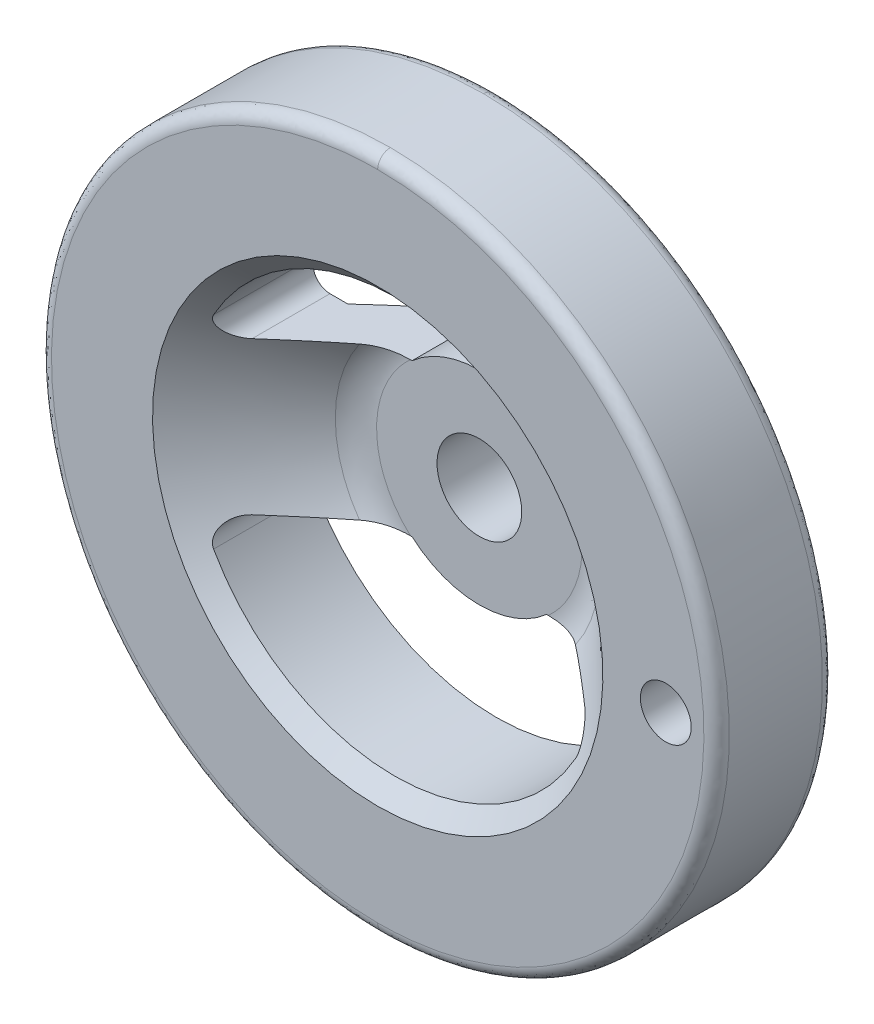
ISO-10303-21;
HEADER;
FILE_DESCRIPTION(('STEP AP214'),'2;1');
FILE_NAME('part.step','',(''),(''),'','','');
FILE_SCHEMA(('AUTOMOTIVE_DESIGN { 1 0 10303 214 1 1 1 1 }'));
ENDSEC;
DATA;
#1=APPLICATION_CONTEXT('core data for automotive mechanical design processes');
#2=APPLICATION_PROTOCOL_DEFINITION('international standard','automotive_design',2000,#1);
#3=PRODUCT_CONTEXT('',#1,'mechanical');
#4=PRODUCT('Part','Part','',(#3));
#5=PRODUCT_RELATED_PRODUCT_CATEGORY('part','',(#4));
#6=PRODUCT_DEFINITION_FORMATION('','',#4);
#7=PRODUCT_DEFINITION_CONTEXT('part definition',#1,'design');
#8=PRODUCT_DEFINITION('design','',#6,#7);
#9=PRODUCT_DEFINITION_SHAPE('','',#8);
#10=(LENGTH_UNIT() NAMED_UNIT(*) SI_UNIT(.MILLI.,.METRE.));
#11=(NAMED_UNIT(*) PLANE_ANGLE_UNIT() SI_UNIT($,.RADIAN.));
#12=(NAMED_UNIT(*) SI_UNIT($,.STERADIAN.) SOLID_ANGLE_UNIT());
#13=UNCERTAINTY_MEASURE_WITH_UNIT(LENGTH_MEASURE(1.E-05),#10,'distance_accuracy_value','');
#14=(GEOMETRIC_REPRESENTATION_CONTEXT(3) GLOBAL_UNCERTAINTY_ASSIGNED_CONTEXT((#13)) GLOBAL_UNIT_ASSIGNED_CONTEXT((#10,
#11,#12)) REPRESENTATION_CONTEXT('',''));
#15=CARTESIAN_POINT('',(0.,0.,0.));
#16=DIRECTION('',(0.,0.,1.));
#17=DIRECTION('',(1.,0.,0.));
#18=AXIS2_PLACEMENT_3D('',#15,#16,#17);
#19=CARTESIAN_POINT('',(-39.098327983,-38.964253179,28.000000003));
#20=DIRECTION('',(0.,0.,-1.));
#21=DIRECTION('',(0.,1.,0.));
#22=AXIS2_PLACEMENT_3D('',#19,#20,#21);
#23=PLANE('',#22);
#24=CARTESIAN_POINT('',(0.,-38.5022264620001,28.000000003));
#25=CARTESIAN_POINT('',(-77.0044529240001,-38.502226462,28.000000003));
#26=CARTESIAN_POINT('',(-77.0044529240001,38.502226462,28.000000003));
#27=CARTESIAN_POINT('',(0.,38.5022264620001,28.000000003));
#28=(BOUNDED_CURVE() B_SPLINE_CURVE(3,(#24,#25,#26,#27),.UNSPECIFIED.,.F.,
.F.) B_SPLINE_CURVE_WITH_KNOTS((4,4),(0.,1.),
.UNSPECIFIED.) CURVE() GEOMETRIC_REPRESENTATION_ITEM() RATIONAL_B_SPLINE_CURVE((0.99999999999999,
0.33333333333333,0.33333333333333,0.99999999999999)) REPRESENTATION_ITEM(''));
#29=CARTESIAN_POINT('',(0.,-38.5022264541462,28.000000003));
#30=VERTEX_POINT('',#29);
#31=CARTESIAN_POINT('',(0.,38.5022264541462,28.000000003));
#32=VERTEX_POINT('',#31);
#33=EDGE_CURVE('E402',#30,#32,#28,.T.);
#34=ORIENTED_EDGE('',*,*,#33,.F.);
#35=CARTESIAN_POINT('',(0.,38.5022264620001,28.000000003));
#36=CARTESIAN_POINT('',(77.0044529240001,38.502226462,28.000000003));
#37=CARTESIAN_POINT('',(77.0044529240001,-38.502226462,28.000000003));
#38=CARTESIAN_POINT('',(0.,-38.5022264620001,28.000000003));
#39=(BOUNDED_CURVE() B_SPLINE_CURVE(3,(#35,#36,#37,#38),.UNSPECIFIED.,.F.,
.F.) B_SPLINE_CURVE_WITH_KNOTS((4,4),(0.,1.),
.UNSPECIFIED.) CURVE() GEOMETRIC_REPRESENTATION_ITEM() RATIONAL_B_SPLINE_CURVE((0.99999999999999,
0.33333333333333,0.33333333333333,0.99999999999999)) REPRESENTATION_ITEM(''));
#40=EDGE_CURVE('E299',#32,#30,#39,.T.);
#41=ORIENTED_EDGE('',*,*,#40,.F.);
#42=EDGE_LOOP('',(#34,#41));
#43=FACE_BOUND('',#42,.T.);
#44=CARTESIAN_POINT('',(0.,0.,28.000000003));
#45=DIRECTION('',(0.,0.,1.));
#46=DIRECTION('',(0.,-1.,0.));
#47=AXIS2_PLACEMENT_3D('',#44,#45,#46);
#48=CIRCLE('',#47,26.576416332);
#49=CARTESIAN_POINT('',(0.,-26.576416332,28.000000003));
#50=VERTEX_POINT('',#49);
#51=EDGE_CURVE('E489',#50,#50,#48,.F.);
#52=ORIENTED_EDGE('',*,*,#51,.T.);
#53=EDGE_LOOP('',(#52));
#54=FACE_BOUND('',#53,.T.);
#55=CARTESIAN_POINT('',(34.,0.,28.000000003));
#56=DIRECTION('',(0.,0.,-1.));
#57=DIRECTION('',(0.,1.,0.));
#58=AXIS2_PLACEMENT_3D('',#55,#56,#57);
#59=CIRCLE('',#58,3.);
#60=CARTESIAN_POINT('',(34.,3.,28.000000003));
#61=VERTEX_POINT('',#60);
#62=EDGE_CURVE('E612',#61,#61,#59,.F.);
#63=ORIENTED_EDGE('',*,*,#62,.F.);
#64=EDGE_LOOP('',(#63));
#65=FACE_BOUND('',#64,.T.);
#66=ADVANCED_FACE('F14',(#43,#54,#65),#23,.F.);
#67=CARTESIAN_POINT('',(-39.09698091,38.962910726,14.000000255));
#68=DIRECTION('',(0.,0.,1.));
#69=DIRECTION('',(0.,-1.,0.));
#70=AXIS2_PLACEMENT_3D('',#67,#68,#69);
#71=PLANE('',#70);
#72=CARTESIAN_POINT('',(0.,38.5008999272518,14.0000002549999));
#73=CARTESIAN_POINT('',(-77.0017998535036,38.5008999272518,14.0000002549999));
#74=CARTESIAN_POINT('',(-77.0017998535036,-38.5008999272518,14.0000002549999));
#75=CARTESIAN_POINT('',(0.,-38.5008999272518,14.0000002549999));
#76=(BOUNDED_CURVE() B_SPLINE_CURVE(3,(#72,#73,#74,#75),.UNSPECIFIED.,.F.,
.F.) B_SPLINE_CURVE_WITH_KNOTS((4,4),(0.,1.),
.UNSPECIFIED.) CURVE() GEOMETRIC_REPRESENTATION_ITEM() RATIONAL_B_SPLINE_CURVE((0.999999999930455,
0.333333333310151,0.333333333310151,0.999999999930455)) REPRESENTATION_ITEM(''));
#77=CARTESIAN_POINT('',(0.,38.5008999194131,14.0000002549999));
#78=VERTEX_POINT('',#77);
#79=CARTESIAN_POINT('',(0.,-38.5008999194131,14.0000002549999));
#80=VERTEX_POINT('',#79);
#81=EDGE_CURVE('E426',#78,#80,#76,.T.);
#82=ORIENTED_EDGE('',*,*,#81,.F.);
#83=CARTESIAN_POINT('',(0.,-38.5008999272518,14.0000002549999));
#84=CARTESIAN_POINT('',(77.0017998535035,-38.5008999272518,14.0000002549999));
#85=CARTESIAN_POINT('',(77.0017998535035,38.5008999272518,14.0000002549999));
#86=CARTESIAN_POINT('',(0.,38.5008999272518,14.0000002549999));
#87=(BOUNDED_CURVE() B_SPLINE_CURVE(3,(#83,#84,#85,#86),.UNSPECIFIED.,.F.,
.F.) B_SPLINE_CURVE_WITH_KNOTS((4,4),(0.,1.),
.UNSPECIFIED.) CURVE() GEOMETRIC_REPRESENTATION_ITEM() RATIONAL_B_SPLINE_CURVE((0.999999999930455,
0.333333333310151,0.333333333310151,0.999999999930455)) REPRESENTATION_ITEM(''));
#88=EDGE_CURVE('E438',#80,#78,#87,.T.);
#89=ORIENTED_EDGE('',*,*,#88,.F.);
#90=EDGE_LOOP('',(#82,#89));
#91=FACE_BOUND('',#90,.T.);
#92=DIRECTION('',(1.,0.,0.));
#93=VECTOR('',#92,1.);
#94=CARTESIAN_POINT('',(0.,-8.99999996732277,14.000000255));
#95=LINE('',#94,#93);
#96=CARTESIAN_POINT('',(-19.627786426,-8.99999998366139,14.000000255));
#97=VERTEX_POINT('',#96);
#98=CARTESIAN_POINT('',(-17.5177379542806,-8.99999998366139,14.0000000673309));
#99=VERTEX_POINT('',#98);
#100=EDGE_CURVE('E451',#97,#99,#95,.T.);
#101=ORIENTED_EDGE('',*,*,#100,.F.);
#102=CARTESIAN_POINT('',(-19.627786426,-11.,14.000000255));
#103=DIRECTION('',(0.,0.,1.));
#104=DIRECTION('',(0.,-1.,0.));
#105=AXIS2_PLACEMENT_3D('',#102,#103,#104);
#106=CIRCLE('',#105,2.);
#107=CARTESIAN_POINT('',(-21.3724785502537,-11.9777777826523,14.000000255));
#108=VERTEX_POINT('',#107);
#109=EDGE_CURVE('E452',#108,#97,#106,.F.);
#110=ORIENTED_EDGE('',*,*,#109,.F.);
#111=CARTESIAN_POINT('',(0.,0.,14.000000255));
#112=DIRECTION('',(0.,0.,1.));
#113=DIRECTION('',(0.,-1.,0.));
#114=AXIS2_PLACEMENT_3D('',#111,#112,#113);
#115=CIRCLE('',#114,24.5);
#116=CARTESIAN_POINT('',(21.3724785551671,-11.9777777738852,14.000000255));
#117=VERTEX_POINT('',#116);
#118=EDGE_CURVE('E9',#108,#117,#115,.T.);
#119=ORIENTED_EDGE('',*,*,#118,.T.);
#120=CARTESIAN_POINT('',(19.627786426,-11.,14.000000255));
#121=DIRECTION('',(0.,0.,1.));
#122=DIRECTION('',(0.,-1.,0.));
#123=AXIS2_PLACEMENT_3D('',#120,#121,#122);
#124=CIRCLE('',#123,2.);
#125=CARTESIAN_POINT('',(19.6277864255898,-8.99999998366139,14.000000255));
#126=VERTEX_POINT('',#125);
#127=EDGE_CURVE('E455',#126,#117,#124,.F.);
#128=ORIENTED_EDGE('',*,*,#127,.F.);
#129=DIRECTION('',(1.,0.,0.));
#130=VECTOR('',#129,1.);
#131=CARTESIAN_POINT('',(0.,-8.99999996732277,14.000000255));
#132=LINE('',#131,#130);
#133=CARTESIAN_POINT('',(17.5177379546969,-8.99999998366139,14.0000000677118));
#134=VERTEX_POINT('',#133);
#135=EDGE_CURVE('E458',#134,#126,#132,.T.);
#136=ORIENTED_EDGE('',*,*,#135,.F.);
#137=CARTESIAN_POINT('',(0.,0.,14.000000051));
#138=DIRECTION('',(0.,0.,1.));
#139=DIRECTION('',(1.,0.,0.));
#140=AXIS2_PLACEMENT_3D('',#137,#138,#139);
#141=CIRCLE('',#140,19.694444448);
#142=CARTESIAN_POINT('',(17.5177379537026,8.99999998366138,14.0000000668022));
#143=VERTEX_POINT('',#142);
#144=EDGE_CURVE('E459',#143,#134,#141,.F.);
#145=ORIENTED_EDGE('',*,*,#144,.F.);
#146=DIRECTION('',(-1.,0.,0.));
#147=VECTOR('',#146,1.);
#148=CARTESIAN_POINT('',(0.,8.99999996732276,14.000000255));
#149=LINE('',#148,#147);
#150=CARTESIAN_POINT('',(19.627786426,8.99999998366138,14.000000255));
#151=VERTEX_POINT('',#150);
#152=EDGE_CURVE('E462',#151,#143,#149,.T.);
#153=ORIENTED_EDGE('',*,*,#152,.F.);
#154=CARTESIAN_POINT('',(19.627786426,11.,14.000000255));
#155=DIRECTION('',(0.,0.,1.));
#156=DIRECTION('',(0.,-1.,0.));
#157=AXIS2_PLACEMENT_3D('',#154,#155,#156);
#158=CIRCLE('',#157,2.);
#159=CARTESIAN_POINT('',(21.372478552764,11.9777777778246,14.000000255));
#160=VERTEX_POINT('',#159);
#161=EDGE_CURVE('E178',#160,#151,#158,.F.);
#162=ORIENTED_EDGE('',*,*,#161,.F.);
#163=CARTESIAN_POINT('',(0.,0.,14.000000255));
#164=DIRECTION('',(0.,0.,1.));
#165=DIRECTION('',(0.,-1.,0.));
#166=AXIS2_PLACEMENT_3D('',#163,#164,#165);
#167=CIRCLE('',#166,24.5);
#168=CARTESIAN_POINT('',(-21.3724785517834,11.9777777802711,14.000000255));
#169=VERTEX_POINT('',#168);
#170=EDGE_CURVE('E464',#169,#160,#167,.F.);
#171=ORIENTED_EDGE('',*,*,#170,.F.);
#172=CARTESIAN_POINT('',(-19.627786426,11.,14.000000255));
#173=DIRECTION('',(0.,0.,1.));
#174=DIRECTION('',(0.,-1.,0.));
#175=AXIS2_PLACEMENT_3D('',#172,#173,#174);
#176=CIRCLE('',#175,2.);
#177=CARTESIAN_POINT('',(-19.6277864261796,8.99999998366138,14.000000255));
#178=VERTEX_POINT('',#177);
#179=EDGE_CURVE('E465',#178,#169,#176,.F.);
#180=ORIENTED_EDGE('',*,*,#179,.F.);
#181=DIRECTION('',(-1.,0.,0.));
#182=VECTOR('',#181,1.);
#183=CARTESIAN_POINT('',(0.,8.99999996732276,14.000000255));
#184=LINE('',#183,#182);
#185=CARTESIAN_POINT('',(-17.5177380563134,8.99999996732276,14.000000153));
#186=VERTEX_POINT('',#185);
#187=EDGE_CURVE('E467',#186,#178,#184,.T.);
#188=ORIENTED_EDGE('',*,*,#187,.F.);
#189=CARTESIAN_POINT('',(0.,0.,14.000000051));
#190=DIRECTION('',(0.,0.,1.));
#191=DIRECTION('',(1.,0.,0.));
#192=AXIS2_PLACEMENT_3D('',#189,#190,#191);
#193=CIRCLE('',#192,19.694444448);
#194=EDGE_CURVE('E447',#99,#186,#193,.F.);
#195=ORIENTED_EDGE('',*,*,#194,.F.);
#196=EDGE_LOOP('',(#101,#110,#119,#128,#136,#145,#153,#162,#171,#180,#188,#195));
#197=FACE_BOUND('',#196,.T.);
#198=CARTESIAN_POINT('',(34.,0.,14.000000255));
#199=DIRECTION('',(0.,0.,1.));
#200=DIRECTION('',(0.,-1.,0.));
#201=AXIS2_PLACEMENT_3D('',#198,#199,#200);
#202=CIRCLE('',#201,3.);
#203=CARTESIAN_POINT('',(34.,-3.,14.000000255));
#204=VERTEX_POINT('',#203);
#205=EDGE_CURVE('E19',#204,#204,#202,.F.);
#206=ORIENTED_EDGE('',*,*,#205,.F.);
#207=EDGE_LOOP('',(#206));
#208=FACE_BOUND('',#207,.T.);
#209=ADVANCED_FACE('F16',(#91,#197,#208),#71,.F.);
#210=CARTESIAN_POINT('',(0.,0.,0.));
#211=DIRECTION('',(0.,0.,1.));
#212=DIRECTION('',(0.,-1.,0.));
#213=AXIS2_PLACEMENT_3D('',#210,#211,#212);
#214=CYLINDRICAL_SURFACE('',#213,5.);
#215=CARTESIAN_POINT('',(0.,0.,16.));
#216=DIRECTION('',(0.,0.,1.));
#217=DIRECTION('',(0.,-1.,0.));
#218=AXIS2_PLACEMENT_3D('',#215,#216,#217);
#219=CIRCLE('',#218,5.);
#220=CARTESIAN_POINT('',(0.,-5.,16.));
#221=VERTEX_POINT('',#220);
#222=EDGE_CURVE('E370',#221,#221,#219,.T.);
#223=ORIENTED_EDGE('',*,*,#222,.T.);
#224=EDGE_LOOP('',(#223));
#225=FACE_BOUND('',#224,.T.);
#226=CARTESIAN_POINT('',(0.,0.,0.));
#227=DIRECTION('',(0.,0.,1.));
#228=DIRECTION('',(0.,-1.,0.));
#229=AXIS2_PLACEMENT_3D('',#226,#227,#228);
#230=CIRCLE('',#229,5.);
#231=CARTESIAN_POINT('',(0.,-5.,0.));
#232=VERTEX_POINT('',#231);
#233=EDGE_CURVE('E614',#232,#232,#230,.F.);
#234=ORIENTED_EDGE('',*,*,#233,.T.);
#235=EDGE_LOOP('',(#234));
#236=FACE_BOUND('',#235,.T.);
#237=ADVANCED_FACE('F604',(#225,#236),#214,.F.);
#238=CARTESIAN_POINT('',(-12.185787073,12.14399994,0.));
#239=DIRECTION('',(0.,0.,1.));
#240=DIRECTION('',(0.,-1.,0.));
#241=AXIS2_PLACEMENT_3D('',#238,#239,#240);
#242=PLANE('',#241);
#243=ORIENTED_EDGE('',*,*,#233,.F.);
#244=EDGE_LOOP('',(#243));
#245=FACE_BOUND('',#244,.T.);
#246=CARTESIAN_POINT('',(0.,0.,0.));
#247=DIRECTION('',(0.,0.,-1.));
#248=DIRECTION('',(0.,1.,0.));
#249=AXIS2_PLACEMENT_3D('',#246,#247,#248);
#250=CIRCLE('',#249,11.999999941);
#251=CARTESIAN_POINT('',(0.,11.999999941,0.));
#252=VERTEX_POINT('',#251);
#253=EDGE_CURVE('E637',#252,#252,#250,.F.);
#254=ORIENTED_EDGE('',*,*,#253,.F.);
#255=EDGE_LOOP('',(#254));
#256=FACE_BOUND('',#255,.T.);
#257=ADVANCED_FACE('F388',(#245,#256),#242,.F.);
#258=CARTESIAN_POINT('',(0.,-40.002225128,26.497999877));
#259=CARTESIAN_POINT('',(-80.0044502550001,-40.002225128,26.497999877));
#260=CARTESIAN_POINT('',(-80.0044502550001,40.002225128,26.497999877));
#261=CARTESIAN_POINT('',(0.,40.002225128,26.497999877));
#262=CARTESIAN_POINT('',(0.,-40.003398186,27.377608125));
#263=CARTESIAN_POINT('',(-80.006796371,-40.003398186,27.377608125));
#264=CARTESIAN_POINT('',(-80.006796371,40.003398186,27.377608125));
#265=CARTESIAN_POINT('',(0.,40.003398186,27.377608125));
#266=CARTESIAN_POINT('',(0.,-39.381835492,28.000000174));
#267=CARTESIAN_POINT('',(-78.7636709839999,-39.381835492,28.000000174));
#268=CARTESIAN_POINT('',(-78.7636709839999,39.381835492,28.000000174));
#269=CARTESIAN_POINT('',(0.,39.381835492,28.000000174));
#270=CARTESIAN_POINT('',(0.,-38.502226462,28.000000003));
#271=CARTESIAN_POINT('',(-77.004452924,-38.502226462,28.000000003));
#272=CARTESIAN_POINT('',(-77.004452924,38.502226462,28.000000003));
#273=CARTESIAN_POINT('',(0.,38.502226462,28.000000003));
#274=(BOUNDED_SURFACE() B_SPLINE_SURFACE(3,3,((#258,#259,#260,#261),(#262,#263,#264,#265),(#266,
#267,#268,#269),(#270,#271,#272,#273)),.UNSPECIFIED.,.F.,.F.,
.F.) B_SPLINE_SURFACE_WITH_KNOTS((4,4),(4,4),(0.,1.),(0.,1.),
.UNSPECIFIED.) GEOMETRIC_REPRESENTATION_ITEM() RATIONAL_B_SPLINE_SURFACE(((1.,0.333333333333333,
0.333333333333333,1.),(0.804423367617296,0.268141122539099,0.268141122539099,0.804423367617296),
(0.804423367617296,0.268141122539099,0.268141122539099,0.804423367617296),(1.,0.333333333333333,
0.333333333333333,1.))) REPRESENTATION_ITEM('') SURFACE());
#275=CARTESIAN_POINT('',(0.,40.002225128,26.497999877));
#276=CARTESIAN_POINT('',(0.,40.003398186,27.377608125));
#277=CARTESIAN_POINT('',(0.,39.381835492,28.000000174));
#278=CARTESIAN_POINT('',(0.,38.502226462,28.000000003));
#279=(BOUNDED_CURVE() B_SPLINE_CURVE(3,(#275,#276,#277,#278),.UNSPECIFIED.,.F.,
.F.) B_SPLINE_CURVE_WITH_KNOTS((4,4),(0.,1.),
.UNSPECIFIED.) CURVE() GEOMETRIC_REPRESENTATION_ITEM() RATIONAL_B_SPLINE_CURVE((1.,
0.804423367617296,0.804423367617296,1.)) REPRESENTATION_ITEM(''));
#280=CARTESIAN_POINT('',(-1.23068902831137E-08,40.002225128,26.497999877));
#281=VERTEX_POINT('',#280);
#282=EDGE_CURVE('E304',#281,#32,#279,.T.);
#283=CARTESIAN_POINT('',(0.,0.,26.497999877));
#284=DIRECTION('',(0.,0.,1.));
#285=DIRECTION('',(0.,-1.,0.));
#286=AXIS2_PLACEMENT_3D('',#283,#284,#285);
#287=CIRCLE('',#286,40.002225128);
#288=CARTESIAN_POINT('',(0.,-40.002225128,26.497999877));
#289=VERTEX_POINT('',#288);
#290=EDGE_CURVE('E360',#289,#281,#287,.F.);
#291=CARTESIAN_POINT('',(0.,-40.002225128,26.497999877));
#292=CARTESIAN_POINT('',(0.,-40.003398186,27.377608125));
#293=CARTESIAN_POINT('',(0.,-39.381835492,28.000000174));
#294=CARTESIAN_POINT('',(0.,-38.502226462,28.000000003));
#295=(BOUNDED_CURVE() B_SPLINE_CURVE(3,(#291,#292,#293,#294),.UNSPECIFIED.,.F.,
.F.) B_SPLINE_CURVE_WITH_KNOTS((4,4),(0.,1.),
.UNSPECIFIED.) CURVE() GEOMETRIC_REPRESENTATION_ITEM() RATIONAL_B_SPLINE_CURVE((1.,
0.804423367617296,0.804423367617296,1.)) REPRESENTATION_ITEM(''));
#296=EDGE_CURVE('E617',#30,#289,#295,.F.);
#297=ORIENTED_EDGE('',*,*,#282,.F.);
#298=ORIENTED_EDGE('',*,*,#290,.F.);
#299=ORIENTED_EDGE('',*,*,#296,.F.);
#300=ORIENTED_EDGE('',*,*,#33,.T.);
#301=EDGE_LOOP('',(#297,#298,#299,#300));
#302=FACE_BOUND('',#301,.T.);
#303=ADVANCED_FACE('F319',(#302),#274,.T.);
#304=CARTESIAN_POINT('',(0.,40.002225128,26.497999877));
#305=CARTESIAN_POINT('',(80.0044502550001,40.002225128,26.497999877));
#306=CARTESIAN_POINT('',(80.0044502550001,-40.002225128,26.497999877));
#307=CARTESIAN_POINT('',(0.,-40.002225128,26.497999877));
#308=CARTESIAN_POINT('',(0.,40.003398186,27.377608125));
#309=CARTESIAN_POINT('',(80.006796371,40.003398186,27.377608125));
#310=CARTESIAN_POINT('',(80.006796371,-40.003398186,27.377608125));
#311=CARTESIAN_POINT('',(0.,-40.003398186,27.377608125));
#312=CARTESIAN_POINT('',(0.,39.381835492,28.000000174));
#313=CARTESIAN_POINT('',(78.7636709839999,39.381835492,28.000000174));
#314=CARTESIAN_POINT('',(78.7636709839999,-39.381835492,28.000000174));
#315=CARTESIAN_POINT('',(0.,-39.381835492,28.000000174));
#316=CARTESIAN_POINT('',(0.,38.502226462,28.000000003));
#317=CARTESIAN_POINT('',(77.004452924,38.502226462,28.000000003));
#318=CARTESIAN_POINT('',(77.004452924,-38.502226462,28.000000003));
#319=CARTESIAN_POINT('',(0.,-38.502226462,28.000000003));
#320=(BOUNDED_SURFACE() B_SPLINE_SURFACE(3,3,((#304,#305,#306,#307),(#308,#309,#310,#311),(#312,
#313,#314,#315),(#316,#317,#318,#319)),.UNSPECIFIED.,.F.,.F.,
.F.) B_SPLINE_SURFACE_WITH_KNOTS((4,4),(4,4),(0.,1.),(0.,1.),
.UNSPECIFIED.) GEOMETRIC_REPRESENTATION_ITEM() RATIONAL_B_SPLINE_SURFACE(((1.,0.333333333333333,
0.333333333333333,1.),(0.804423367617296,0.268141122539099,0.268141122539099,0.804423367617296),
(0.804423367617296,0.268141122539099,0.268141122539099,0.804423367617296),(1.,0.333333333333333,
0.333333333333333,1.))) REPRESENTATION_ITEM('') SURFACE());
#321=CARTESIAN_POINT('',(0.,0.,26.497999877));
#322=DIRECTION('',(0.,0.,1.));
#323=DIRECTION('',(0.,-1.,0.));
#324=AXIS2_PLACEMENT_3D('',#321,#322,#323);
#325=CIRCLE('',#324,40.002225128);
#326=EDGE_CURVE('E367',#281,#289,#325,.F.);
#327=ORIENTED_EDGE('',*,*,#326,.F.);
#328=ORIENTED_EDGE('',*,*,#282,.T.);
#329=ORIENTED_EDGE('',*,*,#40,.T.);
#330=ORIENTED_EDGE('',*,*,#296,.T.);
#331=EDGE_LOOP('',(#327,#328,#329,#330));
#332=FACE_BOUND('',#331,.T.);
#333=ADVANCED_FACE('F306',(#332),#320,.T.);
#334=CARTESIAN_POINT('',(0.,0.,15.499925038));
#335=DIRECTION('',(0.,0.,1.));
#336=DIRECTION('',(0.,-1.,0.));
#337=AXIS2_PLACEMENT_3D('',#334,#335,#336);
#338=CONICAL_SURFACE('',#337,40.001675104,5.00109344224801E-05);
#339=ORIENTED_EDGE('',*,*,#290,.T.);
#340=ORIENTED_EDGE('',*,*,#326,.T.);
#341=EDGE_LOOP('',(#339,#340));
#342=FACE_BOUND('',#341,.T.);
#343=CARTESIAN_POINT('',(0.,0.,15.499925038));
#344=DIRECTION('',(0.,0.,-1.));
#345=DIRECTION('',(0.,1.,0.));
#346=AXIS2_PLACEMENT_3D('',#343,#344,#345);
#347=CIRCLE('',#346,40.001675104);
#348=CARTESIAN_POINT('',(-4.10224035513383E-09,40.001675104,15.499925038));
#349=VERTEX_POINT('',#348);
#350=CARTESIAN_POINT('',(0.,-40.001675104,15.499925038));
#351=VERTEX_POINT('',#350);
#352=EDGE_CURVE('E887',#349,#351,#347,.T.);
#353=ORIENTED_EDGE('',*,*,#352,.F.);
#354=CARTESIAN_POINT('',(0.,0.,15.499925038));
#355=DIRECTION('',(0.,0.,-1.));
#356=DIRECTION('',(0.,1.,0.));
#357=AXIS2_PLACEMENT_3D('',#354,#355,#356);
#358=CIRCLE('',#357,40.001675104);
#359=EDGE_CURVE('E888',#351,#349,#358,.T.);
#360=ORIENTED_EDGE('',*,*,#359,.F.);
#361=EDGE_LOOP('',(#353,#360));
#362=FACE_BOUND('',#361,.T.);
#363=ADVANCED_FACE('F318',(#342,#362),#338,.T.);
#364=CARTESIAN_POINT('',(-12.326043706,-12.144,16.));
#365=DIRECTION('',(0.,0.,-1.));
#366=DIRECTION('',(0.,1.,0.));
#367=AXIS2_PLACEMENT_3D('',#364,#365,#366);
#368=PLANE('',#367);
#369=ORIENTED_EDGE('',*,*,#222,.F.);
#370=EDGE_LOOP('',(#369));
#371=FACE_BOUND('',#370,.T.);
#372=DIRECTION('',(1.,0.,0.));
#373=VECTOR('',#372,1.);
#374=CARTESIAN_POINT('',(-13.7825201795,-9.,15.9999999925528));
#375=LINE('',#374,#373);
#376=CARTESIAN_POINT('',(-8.13234246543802,-9.00000000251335,15.9999999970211));
#377=VERTEX_POINT('',#376);
#378=CARTESIAN_POINT('',(-7.93725388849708,-9.,15.9999999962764));
#379=VERTEX_POINT('',#378);
#380=EDGE_CURVE('E567',#377,#379,#375,.T.);
#381=ORIENTED_EDGE('',*,*,#380,.T.);
#382=CARTESIAN_POINT('',(0.,0.,16.));
#383=DIRECTION('',(0.,0.,-1.));
#384=DIRECTION('',(0.,1.,0.));
#385=AXIS2_PLACEMENT_3D('',#382,#383,#384);
#386=CIRCLE('',#385,11.999999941);
#387=CARTESIAN_POINT('',(7.93725389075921,-9.,15.9999999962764));
#388=VERTEX_POINT('',#387);
#389=EDGE_CURVE('E114',#388,#379,#386,.T.);
#390=ORIENTED_EDGE('',*,*,#389,.F.);
#391=DIRECTION('',(1.,0.,0.));
#392=VECTOR('',#391,1.);
#393=CARTESIAN_POINT('',(13.782520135,-9.,15.9999999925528));
#394=LINE('',#393,#392);
#395=CARTESIAN_POINT('',(8.13234246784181,-9.00000000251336,15.9999999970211));
#396=VERTEX_POINT('',#395);
#397=EDGE_CURVE('E552',#388,#396,#394,.T.);
#398=ORIENTED_EDGE('',*,*,#397,.T.);
#399=CARTESIAN_POINT('',(8.04164683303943,9.08112934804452,16.));
#400=CARTESIAN_POINT('',(13.8876243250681,3.90431877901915,16.));
#401=CARTESIAN_POINT('',(13.8876243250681,-3.90431877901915,16.));
#402=CARTESIAN_POINT('',(8.04164683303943,-9.08112934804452,16.));
#403=(BOUNDED_CURVE() B_SPLINE_CURVE(3,(#399,#400,#401,#402),.UNSPECIFIED.,.F.,
.F.) B_SPLINE_CURVE_WITH_KNOTS((4,4),(0.,1.),
.UNSPECIFIED.) CURVE() GEOMETRIC_REPRESENTATION_ITEM() RATIONAL_B_SPLINE_CURVE((0.999999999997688,
0.775306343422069,0.775306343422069,0.999999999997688)) REPRESENTATION_ITEM(''));
#404=CARTESIAN_POINT('',(8.13234246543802,9.00000000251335,15.9999999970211));
#405=VERTEX_POINT('',#404);
#406=EDGE_CURVE('E121',#396,#405,#403,.F.);
#407=ORIENTED_EDGE('',*,*,#406,.T.);
#408=DIRECTION('',(-1.,0.,0.));
#409=VECTOR('',#408,1.);
#410=CARTESIAN_POINT('',(13.7825201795,9.,15.9999999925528));
#411=LINE('',#410,#409);
#412=CARTESIAN_POINT('',(7.93725388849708,9.,15.9999999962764));
#413=VERTEX_POINT('',#412);
#414=EDGE_CURVE('E492',#405,#413,#411,.T.);
#415=ORIENTED_EDGE('',*,*,#414,.T.);
#416=CARTESIAN_POINT('',(0.,0.,16.));
#417=DIRECTION('',(0.,0.,-1.));
#418=DIRECTION('',(0.,1.,0.));
#419=AXIS2_PLACEMENT_3D('',#416,#417,#418);
#420=CIRCLE('',#419,11.999999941);
#421=CARTESIAN_POINT('',(-7.93725389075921,9.,15.9999999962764));
#422=VERTEX_POINT('',#421);
#423=EDGE_CURVE('E632',#422,#413,#420,.T.);
#424=ORIENTED_EDGE('',*,*,#423,.F.);
#425=DIRECTION('',(-1.,0.,0.));
#426=VECTOR('',#425,1.);
#427=CARTESIAN_POINT('',(-13.782520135,9.,15.9999999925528));
#428=LINE('',#427,#426);
#429=CARTESIAN_POINT('',(-8.13234246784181,9.00000000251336,15.9999999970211));
#430=VERTEX_POINT('',#429);
#431=EDGE_CURVE('E622',#422,#430,#428,.T.);
#432=ORIENTED_EDGE('',*,*,#431,.T.);
#433=CARTESIAN_POINT('',(-8.04164683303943,-9.08112934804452,16.));
#434=CARTESIAN_POINT('',(-13.8876243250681,-3.90431877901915,16.));
#435=CARTESIAN_POINT('',(-13.8876243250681,3.90431877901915,16.));
#436=CARTESIAN_POINT('',(-8.04164683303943,9.08112934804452,16.));
#437=(BOUNDED_CURVE() B_SPLINE_CURVE(3,(#433,#434,#435,#436),.UNSPECIFIED.,.F.,
.F.) B_SPLINE_CURVE_WITH_KNOTS((4,4),(0.,1.),
.UNSPECIFIED.) CURVE() GEOMETRIC_REPRESENTATION_ITEM() RATIONAL_B_SPLINE_CURVE((0.999999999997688,
0.775306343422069,0.775306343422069,0.999999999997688)) REPRESENTATION_ITEM(''));
#438=EDGE_CURVE('E641',#430,#377,#437,.F.);
#439=ORIENTED_EDGE('',*,*,#438,.T.);
#440=EDGE_LOOP('',(#381,#390,#398,#407,#415,#424,#432,#439));
#441=FACE_BOUND('',#440,.T.);
#442=ADVANCED_FACE('F330',(#371,#441),#368,.F.);
#443=CARTESIAN_POINT('',(-8.041646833,-9.081129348,16.));
#444=CARTESIAN_POINT('',(-13.887624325,-3.904318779,16.));
#445=CARTESIAN_POINT('',(-13.887624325,3.904318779,16.));
#446=CARTESIAN_POINT('',(-8.041646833,9.081129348,16.));
#447=CARTESIAN_POINT('',(-8.91171345,-10.063662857,16.));
#448=CARTESIAN_POINT('',(-15.39019694,-4.326746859,16.));
#449=CARTESIAN_POINT('',(-15.39019694,4.326746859,16.));
#450=CARTESIAN_POINT('',(-8.91171345,10.063662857,16.));
#451=CARTESIAN_POINT('',(-9.718425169,-10.974652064,16.491632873));
#452=CARTESIAN_POINT('',(-16.783358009,-4.718415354,16.491632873));
#453=CARTESIAN_POINT('',(-16.783358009,4.718415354,16.491632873));
#454=CARTESIAN_POINT('',(-9.718425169,10.974652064,16.491632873));
#455=CARTESIAN_POINT('',(-10.344298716,-11.681427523,17.403300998));
#456=CARTESIAN_POINT('',(-17.864218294,-5.022284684,17.403300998));
#457=CARTESIAN_POINT('',(-17.864218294,5.022284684,17.403300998));
#458=CARTESIAN_POINT('',(-10.344298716,11.681427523,17.403300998));
#459=(BOUNDED_SURFACE() B_SPLINE_SURFACE(3,3,((#443,#444,#445,#446),(#447,#448,#449,#450),(#451,
#452,#453,#454),(#455,#456,#457,#458)),.UNSPECIFIED.,.F.,.F.,
.F.) B_SPLINE_SURFACE_WITH_KNOTS((4,4),(4,4),(0.,1.),(0.,1.),
.UNSPECIFIED.) GEOMETRIC_REPRESENTATION_ITEM() RATIONAL_B_SPLINE_SURFACE(((1.,0.775306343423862,
0.775306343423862,1.),(0.951455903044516,0.737669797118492,0.737669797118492,0.951455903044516),
(0.951455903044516,0.737669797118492,0.737669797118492,0.951455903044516),(1.,0.775306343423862,
0.775306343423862,1.))) REPRESENTATION_ITEM('') SURFACE());
#460=CARTESIAN_POINT('',(-12.7459901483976,-9.,17.403300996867));
#461=CARTESIAN_POINT('',(-12.5914108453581,-9.,17.2813199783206));
#462=CARTESIAN_POINT('',(-12.4303082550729,-9.,17.167858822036));
#463=CARTESIAN_POINT('',(-12.0979932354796,-9.,16.9581611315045));
#464=CARTESIAN_POINT('',(-11.9268168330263,-9.,16.861867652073));
#465=CARTESIAN_POINT('',(-11.5832870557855,-9.,16.68941869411));
#466=CARTESIAN_POINT('',(-11.4112598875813,-9.,16.6126074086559));
#467=CARTESIAN_POINT('',(-11.0612936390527,-9.,16.4737052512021));
#468=CARTESIAN_POINT('',(-10.8833517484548,-9.,16.411621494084));
#469=CARTESIAN_POINT('',(-10.5224608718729,-9.,16.3013122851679));
#470=CARTESIAN_POINT('',(-10.3394944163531,-9.,16.2531444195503));
#471=CARTESIAN_POINT('',(-9.97054227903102,-9.,16.1701444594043));
#472=CARTESIAN_POINT('',(-9.78455584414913,-9.,16.1353157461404));
#473=CARTESIAN_POINT('',(-9.35442624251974,-9.,16.0694426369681));
#474=CARTESIAN_POINT('',(-9.10963157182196,-9.,16.0426942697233));
#475=CARTESIAN_POINT('',(-8.62058950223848,-9.,16.0080320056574));
#476=CARTESIAN_POINT('',(-8.37635255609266,-9.,15.9999737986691));
#477=CARTESIAN_POINT('',(-8.13234246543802,-9.,16.));
#478=B_SPLINE_CURVE_WITH_KNOTS('',3,(#460,#461,#462,#463,#464,#465,#466,#467,#468,#469,#470,
#471,#472,#473,#474,#475,#476,#477),.UNSPECIFIED.,.F.,.F.,(4,2,2,2,2,2,2,2,4),(0.,
0.590219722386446,1.17844370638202,1.74293208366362,2.30769261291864,2.87475779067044,
3.44196661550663,4.17993813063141,4.91219238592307),.UNSPECIFIED.);
#479=CARTESIAN_POINT('',(-12.7459901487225,-9.,17.4033009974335));
#480=VERTEX_POINT('',#479);
#481=EDGE_CURVE('E649',#480,#377,#478,.T.);
#482=CARTESIAN_POINT('',(-8.13234246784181,9.,16.));
#483=CARTESIAN_POINT('',(-8.38012953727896,9.,15.9999731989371));
#484=CARTESIAN_POINT('',(-8.62814690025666,9.,16.0082829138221));
#485=CARTESIAN_POINT('',(-9.12350937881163,9.,16.0439762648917));
#486=CARTESIAN_POINT('',(-9.3708503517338,9.,16.0714161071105));
#487=CARTESIAN_POINT('',(-9.8252726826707,9.,16.1420520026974));
#488=CARTESIAN_POINT('',(-10.0328117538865,9.,16.1822559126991));
#489=CARTESIAN_POINT('',(-10.4436058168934,9.,16.2794177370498));
#490=CARTESIAN_POINT('',(-10.646867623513,9.,16.3363464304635));
#491=CARTESIAN_POINT('',(-11.017115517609,9.,16.4581119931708));
#492=CARTESIAN_POINT('',(-11.1849262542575,9.,16.5204383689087));
#493=CARTESIAN_POINT('',(-11.5149432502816,9.,16.6585270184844));
#494=CARTESIAN_POINT('',(-11.6771499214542,9.,16.7342883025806));
#495=CARTESIAN_POINT('',(-11.9959303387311,9.,16.900448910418));
#496=CARTESIAN_POINT('',(-12.1524345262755,9.,16.9909825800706));
#497=CARTESIAN_POINT('',(-12.4564679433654,9.,17.1863754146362));
#498=CARTESIAN_POINT('',(-12.6039864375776,9.,17.2912512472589));
#499=CARTESIAN_POINT('',(-12.7459901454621,9.,17.4033009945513));
#500=B_SPLINE_CURVE_WITH_KNOTS('',3,(#482,#483,#484,#485,#486,#487,#488,#489,#490,#491,#492,
#493,#494,#495,#496,#497,#498,#499),.UNSPECIFIED.,.F.,.F.,(4,2,2,2,2,2,2,2,4),(0.,
0.743579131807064,1.48935222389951,2.12290775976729,2.7553628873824,3.29185625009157,
3.82831010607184,4.36994660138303,4.91221799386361),.UNSPECIFIED.);
#501=CARTESIAN_POINT('',(-12.7459901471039,9.,17.4033009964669));
#502=VERTEX_POINT('',#501);
#503=EDGE_CURVE('E594',#430,#502,#500,.T.);
#504=CARTESIAN_POINT('',(0.,0.,17.403300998));
#505=DIRECTION('',(0.,0.,1.));
#506=DIRECTION('',(0.,-1.,0.));
#507=AXIS2_PLACEMENT_3D('',#504,#505,#506);
#508=CIRCLE('',#507,15.603213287);
#509=EDGE_CURVE('E591',#502,#480,#508,.T.);
#510=ORIENTED_EDGE('',*,*,#481,.T.);
#511=ORIENTED_EDGE('',*,*,#438,.F.);
#512=ORIENTED_EDGE('',*,*,#503,.T.);
#513=ORIENTED_EDGE('',*,*,#509,.T.);
#514=EDGE_LOOP('',(#510,#511,#512,#513));
#515=FACE_BOUND('',#514,.T.);
#516=ADVANCED_FACE('F332',(#515),#459,.F.);
#517=CARTESIAN_POINT('',(0.,0.,16.));
#518=DIRECTION('',(0.,0.,-1.));
#519=DIRECTION('',(0.,1.,0.));
#520=AXIS2_PLACEMENT_3D('',#517,#518,#519);
#521=CYLINDRICAL_SURFACE('',#520,11.999999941);
#522=DIRECTION('',(0.,0.,1.));
#523=VECTOR('',#522,1.);
#524=CARTESIAN_POINT('',(7.93725393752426,-9.,14.6365570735));
#525=LINE('',#524,#523);
#526=CARTESIAN_POINT('',(7.93725389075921,-9.,6.08571442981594));
#527=VERTEX_POINT('',#526);
#528=EDGE_CURVE('E545',#527,#388,#525,.T.);
#529=ORIENTED_EDGE('',*,*,#528,.T.);
#530=ORIENTED_EDGE('',*,*,#389,.T.);
#531=DIRECTION('',(0.,0.,-1.));
#532=VECTOR('',#531,1.);
#533=CARTESIAN_POINT('',(-7.937253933,-9.,14.6365570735));
#534=LINE('',#533,#532);
#535=CARTESIAN_POINT('',(-7.93725388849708,-9.,6.08571442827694));
#536=VERTEX_POINT('',#535);
#537=EDGE_CURVE('E564',#379,#536,#534,.T.);
#538=ORIENTED_EDGE('',*,*,#537,.T.);
#539=CARTESIAN_POINT('',(0.,0.,6.08571439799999));
#540=DIRECTION('',(0.,0.,1.));
#541=DIRECTION('',(0.,-1.,0.));
#542=AXIS2_PLACEMENT_3D('',#539,#540,#541);
#543=CIRCLE('',#542,11.999999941);
#544=CARTESIAN_POINT('',(-7.93725389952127,9.,6.0857144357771));
#545=VERTEX_POINT('',#544);
#546=EDGE_CURVE('E652',#545,#536,#543,.T.);
#547=ORIENTED_EDGE('',*,*,#546,.F.);
#548=DIRECTION('',(0.,0.,1.));
#549=VECTOR('',#548,1.);
#550=CARTESIAN_POINT('',(-7.93725393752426,9.,14.6365570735));
#551=LINE('',#550,#549);
#552=EDGE_CURVE('E587',#545,#422,#551,.T.);
#553=ORIENTED_EDGE('',*,*,#552,.T.);
#554=ORIENTED_EDGE('',*,*,#423,.T.);
#555=DIRECTION('',(0.,0.,-1.));
#556=VECTOR('',#555,1.);
#557=CARTESIAN_POINT('',(7.937253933,9.,14.6365570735));
#558=LINE('',#557,#556);
#559=CARTESIAN_POINT('',(7.93725388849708,9.,6.08571442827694));
#560=VERTEX_POINT('',#559);
#561=EDGE_CURVE('E184',#413,#560,#558,.T.);
#562=ORIENTED_EDGE('',*,*,#561,.T.);
#563=CARTESIAN_POINT('',(0.,0.,6.08571439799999));
#564=DIRECTION('',(0.,0.,1.));
#565=DIRECTION('',(0.,-1.,0.));
#566=AXIS2_PLACEMENT_3D('',#563,#564,#565);
#567=CIRCLE('',#566,11.999999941);
#568=EDGE_CURVE('E554',#527,#560,#567,.T.);
#569=ORIENTED_EDGE('',*,*,#568,.F.);
#570=EDGE_LOOP('',(#529,#530,#538,#547,#553,#554,#562,#569));
#571=FACE_BOUND('',#570,.T.);
#572=ORIENTED_EDGE('',*,*,#253,.T.);
#573=EDGE_LOOP('',(#572));
#574=FACE_BOUND('',#573,.T.);
#575=ADVANCED_FACE('F266',(#571,#574),#521,.T.);
#576=CARTESIAN_POINT('',(8.041646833,9.081129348,16.));
#577=CARTESIAN_POINT('',(13.887624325,3.904318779,16.));
#578=CARTESIAN_POINT('',(13.887624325,-3.904318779,16.));
#579=CARTESIAN_POINT('',(8.041646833,-9.081129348,16.));
#580=CARTESIAN_POINT('',(8.91171345,10.063662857,16.));
#581=CARTESIAN_POINT('',(15.39019694,4.326746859,16.));
#582=CARTESIAN_POINT('',(15.39019694,-4.326746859,16.));
#583=CARTESIAN_POINT('',(8.91171345,-10.063662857,16.));
#584=CARTESIAN_POINT('',(9.718425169,10.974652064,16.491632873));
#585=CARTESIAN_POINT('',(16.783358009,4.718415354,16.491632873));
#586=CARTESIAN_POINT('',(16.783358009,-4.718415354,16.491632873));
#587=CARTESIAN_POINT('',(9.718425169,-10.974652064,16.491632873));
#588=CARTESIAN_POINT('',(10.344298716,11.681427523,17.403300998));
#589=CARTESIAN_POINT('',(17.864218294,5.022284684,17.403300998));
#590=CARTESIAN_POINT('',(17.864218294,-5.022284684,17.403300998));
#591=CARTESIAN_POINT('',(10.344298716,-11.681427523,17.403300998));
#592=(BOUNDED_SURFACE() B_SPLINE_SURFACE(3,3,((#576,#577,#578,#579),(#580,#581,#582,#583),(#584,
#585,#586,#587),(#588,#589,#590,#591)),.UNSPECIFIED.,.F.,.F.,
.F.) B_SPLINE_SURFACE_WITH_KNOTS((4,4),(4,4),(0.,1.),(0.,1.),
.UNSPECIFIED.) GEOMETRIC_REPRESENTATION_ITEM() RATIONAL_B_SPLINE_SURFACE(((1.,0.775306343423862,
0.775306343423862,1.),(0.951455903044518,0.737669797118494,0.737669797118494,0.951455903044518),
(0.951455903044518,0.737669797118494,0.737669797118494,0.951455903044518),(1.,0.775306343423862,
0.775306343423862,1.))) REPRESENTATION_ITEM('') SURFACE());
#593=CARTESIAN_POINT('',(8.13234246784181,-9.,16.));
#594=CARTESIAN_POINT('',(8.38012953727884,-9.,15.9999731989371));
#595=CARTESIAN_POINT('',(8.62814690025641,-9.,16.0082829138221));
#596=CARTESIAN_POINT('',(9.12350937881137,-9.,16.0439762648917));
#597=CARTESIAN_POINT('',(9.37085035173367,-9.,16.0714161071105));
#598=CARTESIAN_POINT('',(9.8252726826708,-9.,16.1420520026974));
#599=CARTESIAN_POINT('',(10.0328117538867,-9.,16.1822559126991));
#600=CARTESIAN_POINT('',(10.4436058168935,-9.,16.2794177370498));
#601=CARTESIAN_POINT('',(10.646867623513,-9.,16.3363464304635));
#602=CARTESIAN_POINT('',(11.0171155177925,-9.,16.4581119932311));
#603=CARTESIAN_POINT('',(11.18492625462,-9.,16.5204383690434));
#604=CARTESIAN_POINT('',(11.5149432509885,-9.,16.6585270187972));
#605=CARTESIAN_POINT('',(11.6771499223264,-9.,16.7342883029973));
#606=CARTESIAN_POINT('',(11.9959303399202,-9.,16.9004489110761));
#607=CARTESIAN_POINT('',(12.152434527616,-9.,16.990982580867));
#608=CARTESIAN_POINT('',(12.456467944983,-9.,17.1863754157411));
#609=CARTESIAN_POINT('',(12.6039864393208,-9.,17.2912512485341));
#610=CARTESIAN_POINT('',(12.7459901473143,-9.,17.4033009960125));
#611=B_SPLINE_CURVE_WITH_KNOTS('',3,(#593,#594,#595,#596,#597,#598,#599,#600,#601,#602,#603,
#604,#605,#606,#607,#608,#609,#610),.UNSPECIFIED.,.F.,.F.,(4,2,2,2,2,2,2,2,4),(0.,
0.74357913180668,1.48935222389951,2.12290775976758,2.75536288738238,3.29185625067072,
3.82831010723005,4.36994660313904,4.91221799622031),.UNSPECIFIED.);
#612=CARTESIAN_POINT('',(12.7459901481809,-9.,17.4033009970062));
#613=VERTEX_POINT('',#612);
#614=EDGE_CURVE('E546',#396,#613,#611,.T.);
#615=CARTESIAN_POINT('',(0.,0.,17.403300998));
#616=DIRECTION('',(0.,0.,1.));
#617=DIRECTION('',(0.,-1.,0.));
#618=AXIS2_PLACEMENT_3D('',#615,#616,#617);
#619=CIRCLE('',#618,15.603213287);
#620=CARTESIAN_POINT('',(12.7459901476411,9.,17.4033009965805));
#621=VERTEX_POINT('',#620);
#622=EDGE_CURVE('E197',#613,#621,#619,.T.);
#623=CARTESIAN_POINT('',(12.745990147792,9.,17.4033009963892));
#624=CARTESIAN_POINT('',(12.5914108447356,9.,17.2813199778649));
#625=CARTESIAN_POINT('',(12.4303082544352,9.,17.1678588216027));
#626=CARTESIAN_POINT('',(12.0979932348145,9.,16.9581611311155));
#627=CARTESIAN_POINT('',(11.926816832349,9.,16.8618676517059));
#628=CARTESIAN_POINT('',(11.5832870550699,9.,16.6894186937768));
#629=CARTESIAN_POINT('',(11.4112598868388,9.,16.6126074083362));
#630=CARTESIAN_POINT('',(11.0612936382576,9.,16.4737052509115));
#631=CARTESIAN_POINT('',(10.883351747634,9.,16.4116214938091));
#632=CARTESIAN_POINT('',(10.5224608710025,9.,16.301312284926));
#633=CARTESIAN_POINT('',(10.3394944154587,9.,16.2531444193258));
#634=CARTESIAN_POINT('',(9.97054227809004,9.,16.1701444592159));
#635=CARTESIAN_POINT('',(9.7845558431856,9.,16.1353157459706));
#636=CARTESIAN_POINT('',(9.35442624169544,9.,16.0694426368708));
#637=CARTESIAN_POINT('',(9.1096315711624,9.,16.042694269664));
#638=CARTESIAN_POINT('',(8.62058950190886,9.,16.0080320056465));
#639=CARTESIAN_POINT('',(8.3763525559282,9.,15.9999737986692));
#640=CARTESIAN_POINT('',(8.13234246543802,9.,16.));
#641=B_SPLINE_CURVE_WITH_KNOTS('',3,(#623,#624,#625,#626,#627,#628,#629,#630,#631,#632,#633,
#634,#635,#636,#637,#638,#639,#640),.UNSPECIFIED.,.F.,.F.,(4,2,2,2,2,2,2,2,4),(0.,
0.590219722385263,1.17844370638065,1.74293208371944,2.30769261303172,2.87475779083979,
3.44196661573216,4.17993813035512,4.91219238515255),.UNSPECIFIED.);
#642=EDGE_CURVE('E183',#621,#405,#641,.T.);
#643=ORIENTED_EDGE('',*,*,#614,.T.);
#644=ORIENTED_EDGE('',*,*,#622,.T.);
#645=ORIENTED_EDGE('',*,*,#642,.T.);
#646=ORIENTED_EDGE('',*,*,#406,.F.);
#647=EDGE_LOOP('',(#643,#644,#645,#646));
#648=FACE_BOUND('',#647,.T.);
#649=ADVANCED_FACE('F258',(#648),#592,.F.);
#650=CARTESIAN_POINT('',(0.,-38.500899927,14.000000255));
#651=CARTESIAN_POINT('',(-77.001799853,-38.500899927,14.000000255));
#652=CARTESIAN_POINT('',(-77.001799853,38.500899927,14.000000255));
#653=CARTESIAN_POINT('',(0.,38.500899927,14.000000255));
#654=CARTESIAN_POINT('',(0.,-39.379904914,13.999545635));
#655=CARTESIAN_POINT('',(-78.759809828,-39.379904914,13.999545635));
#656=CARTESIAN_POINT('',(-78.759809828,39.379904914,13.999545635));
#657=CARTESIAN_POINT('',(0.,39.379904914,13.999545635));
#658=CARTESIAN_POINT('',(0.,-40.001631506,14.620919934));
#659=CARTESIAN_POINT('',(-80.003263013,-40.001631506,14.620919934));
#660=CARTESIAN_POINT('',(-80.003263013,40.001631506,14.620919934));
#661=CARTESIAN_POINT('',(0.,40.001631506,14.620919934));
#662=CARTESIAN_POINT('',(0.,-40.001675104,15.499925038));
#663=CARTESIAN_POINT('',(-80.0033502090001,-40.001675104,15.499925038));
#664=CARTESIAN_POINT('',(-80.0033502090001,40.001675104,15.499925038));
#665=CARTESIAN_POINT('',(0.,40.001675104,15.499925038));
#666=(BOUNDED_SURFACE() B_SPLINE_SURFACE(3,3,((#650,#651,#652,#653),(#654,#655,#656,#657),(#658,
#659,#660,#661),(#662,#663,#664,#665)),.UNSPECIFIED.,.F.,.F.,
.F.) B_SPLINE_SURFACE_WITH_KNOTS((4,4),(4,4),(0.,1.),(0.,1.),
.UNSPECIFIED.) GEOMETRIC_REPRESENTATION_ITEM() RATIONAL_B_SPLINE_SURFACE(((1.,0.333333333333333,
0.333333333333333,1.),(0.804627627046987,0.268209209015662,0.268209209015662,0.804627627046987),
(0.804627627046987,0.268209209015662,0.268209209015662,0.804627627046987),(1.,0.333333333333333,
0.333333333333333,1.))) REPRESENTATION_ITEM('') SURFACE());
#667=CARTESIAN_POINT('',(0.,38.500899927,14.000000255));
#668=CARTESIAN_POINT('',(0.,39.379904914,13.999545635));
#669=CARTESIAN_POINT('',(0.,40.001631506,14.620919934));
#670=CARTESIAN_POINT('',(0.,40.001675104,15.499925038));
#671=(BOUNDED_CURVE() B_SPLINE_CURVE(3,(#667,#668,#669,#670),.UNSPECIFIED.,.F.,
.F.) B_SPLINE_CURVE_WITH_KNOTS((4,4),(0.,1.),
.UNSPECIFIED.) CURVE() GEOMETRIC_REPRESENTATION_ITEM() RATIONAL_B_SPLINE_CURVE((1.,
0.804627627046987,0.804627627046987,1.)) REPRESENTATION_ITEM(''));
#672=EDGE_CURVE('E625',#78,#349,#671,.T.);
#673=CARTESIAN_POINT('',(0.,-38.500899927,14.000000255));
#674=CARTESIAN_POINT('',(0.,-39.379904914,13.999545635));
#675=CARTESIAN_POINT('',(0.,-40.001631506,14.620919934));
#676=CARTESIAN_POINT('',(0.,-40.001675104,15.499925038));
#677=(BOUNDED_CURVE() B_SPLINE_CURVE(3,(#673,#674,#675,#676),.UNSPECIFIED.,.F.,
.F.) B_SPLINE_CURVE_WITH_KNOTS((4,4),(0.,1.),
.UNSPECIFIED.) CURVE() GEOMETRIC_REPRESENTATION_ITEM() RATIONAL_B_SPLINE_CURVE((1.,
0.804627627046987,0.804627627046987,1.)) REPRESENTATION_ITEM(''));
#678=EDGE_CURVE('E504',#351,#80,#677,.F.);
#679=ORIENTED_EDGE('',*,*,#672,.F.);
#680=ORIENTED_EDGE('',*,*,#81,.T.);
#681=ORIENTED_EDGE('',*,*,#678,.F.);
#682=ORIENTED_EDGE('',*,*,#359,.T.);
#683=EDGE_LOOP('',(#679,#680,#681,#682));
#684=FACE_BOUND('',#683,.T.);
#685=ADVANCED_FACE('F265',(#684),#666,.T.);
#686=CARTESIAN_POINT('',(0.,38.500899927,14.000000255));
#687=CARTESIAN_POINT('',(77.001799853,38.500899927,14.000000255));
#688=CARTESIAN_POINT('',(77.001799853,-38.500899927,14.000000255));
#689=CARTESIAN_POINT('',(0.,-38.500899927,14.000000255));
#690=CARTESIAN_POINT('',(0.,39.379904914,13.999545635));
#691=CARTESIAN_POINT('',(78.759809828,39.379904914,13.999545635));
#692=CARTESIAN_POINT('',(78.759809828,-39.379904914,13.999545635));
#693=CARTESIAN_POINT('',(0.,-39.379904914,13.999545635));
#694=CARTESIAN_POINT('',(0.,40.001631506,14.620919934));
#695=CARTESIAN_POINT('',(80.003263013,40.001631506,14.620919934));
#696=CARTESIAN_POINT('',(80.003263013,-40.001631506,14.620919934));
#697=CARTESIAN_POINT('',(0.,-40.001631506,14.620919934));
#698=CARTESIAN_POINT('',(0.,40.001675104,15.499925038));
#699=CARTESIAN_POINT('',(80.0033502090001,40.001675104,15.499925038));
#700=CARTESIAN_POINT('',(80.0033502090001,-40.001675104,15.499925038));
#701=CARTESIAN_POINT('',(0.,-40.001675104,15.499925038));
#702=(BOUNDED_SURFACE() B_SPLINE_SURFACE(3,3,((#686,#687,#688,#689),(#690,#691,#692,#693),(#694,
#695,#696,#697),(#698,#699,#700,#701)),.UNSPECIFIED.,.F.,.F.,
.F.) B_SPLINE_SURFACE_WITH_KNOTS((4,4),(4,4),(0.,1.),(0.,1.),
.UNSPECIFIED.) GEOMETRIC_REPRESENTATION_ITEM() RATIONAL_B_SPLINE_SURFACE(((1.,0.333333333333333,
0.333333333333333,1.),(0.804627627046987,0.268209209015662,0.268209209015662,0.804627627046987),
(0.804627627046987,0.268209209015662,0.268209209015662,0.804627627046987),(1.,0.333333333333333,
0.333333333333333,1.))) REPRESENTATION_ITEM('') SURFACE());
#703=ORIENTED_EDGE('',*,*,#88,.T.);
#704=ORIENTED_EDGE('',*,*,#672,.T.);
#705=ORIENTED_EDGE('',*,*,#352,.T.);
#706=ORIENTED_EDGE('',*,*,#678,.T.);
#707=EDGE_LOOP('',(#703,#704,#705,#706));
#708=FACE_BOUND('',#707,.T.);
#709=ADVANCED_FACE('F506',(#708),#702,.T.);
#710=CARTESIAN_POINT('',(-19.627786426,9.,23.290009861));
#711=DIRECTION('',(0.,-1.,0.));
#712=DIRECTION('',(0.,0.,-1.));
#713=AXIS2_PLACEMENT_3D('',#710,#711,#712);
#714=PLANE('',#713);
#715=CARTESIAN_POINT('',(-17.5177379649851,9.,14.0000000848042));
#716=CARTESIAN_POINT('',(-17.1353634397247,9.,13.6502155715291));
#717=CARTESIAN_POINT('',(-16.7518364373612,9.,13.3016802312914));
#718=CARTESIAN_POINT('',(-15.9819431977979,9.,12.607755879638));
#719=CARTESIAN_POINT('',(-15.5955769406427,9.,12.2623668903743));
#720=CARTESIAN_POINT('',(-14.8198955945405,9.,11.5757593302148));
#721=CARTESIAN_POINT('',(-14.4305841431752,9.,11.2345366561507));
#722=CARTESIAN_POINT('',(-13.6478955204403,9.,10.5567877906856));
#723=CARTESIAN_POINT('',(-13.2545183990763,9.,10.2202615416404));
#724=CARTESIAN_POINT('',(-12.4624551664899,9.,9.55281193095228));
#725=CARTESIAN_POINT('',(-12.063764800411,9.,9.22189361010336));
#726=CARTESIAN_POINT('',(-11.2602732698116,9.,8.56761518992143));
#727=CARTESIAN_POINT('',(-10.855472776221,9.,8.24425427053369));
#728=CARTESIAN_POINT('',(-10.2422838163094,9.,7.76642599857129));
#729=CARTESIAN_POINT('',(-10.0367718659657,9.,7.60826493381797));
#730=CARTESIAN_POINT('',(-9.62358333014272,9.,7.29480328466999));
#731=CARTESIAN_POINT('',(-9.41590680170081,9.,7.13950262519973));
#732=CARTESIAN_POINT('',(-8.99804307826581,9.,6.8321469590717));
#733=CARTESIAN_POINT('',(-8.7878549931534,9.,6.68009315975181));
#734=CARTESIAN_POINT('',(-8.36470749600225,9.,6.37985399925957));
#735=CARTESIAN_POINT('',(-8.15174783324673,9.,6.2316689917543));
#736=CARTESIAN_POINT('',(-7.93725386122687,9.,6.08571440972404));
#737=B_SPLINE_CURVE_WITH_KNOTS('',3,(#715,#716,#717,#718,#719,#720,#721,#722,#723,#724,#725,
#726,#727,#728,#729,#730,#731,#732,#733,#734,#735,#736),.UNSPECIFIED.,.F.,.F.,(4,2,2,2,2,2,2,2,
2,2,4),(0.,1.55468977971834,3.10939049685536,4.66241123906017,6.21541290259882,7.7697434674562,
9.32390458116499,10.1018631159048,10.879801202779,11.6580236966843,12.4363170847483),.UNSPECIFIED.);
#738=EDGE_CURVE('E490',#186,#545,#737,.T.);
#739=ORIENTED_EDGE('',*,*,#738,.F.);
#740=ORIENTED_EDGE('',*,*,#187,.T.);
#741=DIRECTION('',(0.,0.,1.));
#742=VECTOR('',#741,1.);
#743=CARTESIAN_POINT('',(-19.6277864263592,9.,20.03339864));
#744=LINE('',#743,#742);
#745=CARTESIAN_POINT('',(-19.6277864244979,9.,23.1873997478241));
#746=VERTEX_POINT('',#745);
#747=EDGE_CURVE('E495',#178,#746,#744,.T.);
#748=ORIENTED_EDGE('',*,*,#747,.T.);
#749=CARTESIAN_POINT('',(-12.7459901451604,9.,17.4033009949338));
#750=CARTESIAN_POINT('',(-13.04013683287,9.,17.6353662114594));
#751=CARTESIAN_POINT('',(-13.3330051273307,9.,17.8690424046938));
#752=CARTESIAN_POINT('',(-13.9164877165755,9.,18.3391783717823));
#753=CARTESIAN_POINT('',(-14.207102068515,9.,18.5756380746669));
#754=CARTESIAN_POINT('',(-14.7863480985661,9.,19.0508764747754));
#755=CARTESIAN_POINT('',(-15.0749800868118,9.,19.2896547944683));
#756=CARTESIAN_POINT('',(-15.6505533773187,9.,19.769242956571));
#757=CARTESIAN_POINT('',(-15.9374946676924,9.,20.0100528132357));
#758=CARTESIAN_POINT('',(-16.7960589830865,9.,20.7350624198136));
#759=CARTESIAN_POINT('',(-17.3654709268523,9.,21.2218821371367));
#760=CARTESIAN_POINT('',(-18.2161867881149,9.,21.9561341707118));
#761=CARTESIAN_POINT('',(-18.4992152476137,9.,22.2015759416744));
#762=CARTESIAN_POINT('',(-19.0642423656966,9.,22.6936393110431));
#763=CARTESIAN_POINT('',(-19.3462410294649,9.,22.9402609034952));
#764=CARTESIAN_POINT('',(-19.6277864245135,9.,23.1873997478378));
#765=B_SPLINE_CURVE_WITH_KNOTS('',3,(#749,#750,#751,#752,#753,#754,#755,#756,#757,#758,#759,
#760,#761,#762,#763,#764),.UNSPECIFIED.,.F.,.F.,(4,2,2,2,2,2,2,4),(0.,1.12399159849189,
2.24795460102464,3.37173756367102,4.49552841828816,6.74292173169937,7.86680628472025,
8.9906851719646),.UNSPECIFIED.);
#766=EDGE_CURVE('E589',#502,#746,#765,.T.);
#767=ORIENTED_EDGE('',*,*,#766,.F.);
#768=ORIENTED_EDGE('',*,*,#503,.F.);
#769=ORIENTED_EDGE('',*,*,#431,.F.);
#770=ORIENTED_EDGE('',*,*,#552,.F.);
#771=EDGE_LOOP('',(#739,#740,#748,#767,#768,#769,#770));
#772=FACE_BOUND('',#771,.T.);
#773=ADVANCED_FACE('F227',(#772),#714,.F.);
#774=CARTESIAN_POINT('',(-19.627786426,11.,14.000000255));
#775=DIRECTION('',(0.,0.,1.));
#776=DIRECTION('',(0.,-1.,0.));
#777=AXIS2_PLACEMENT_3D('',#774,#775,#776);
#778=CYLINDRICAL_SURFACE('',#777,2.);
#779=ORIENTED_EDGE('',*,*,#179,.T.);
#780=DIRECTION('',(0.,0.,1.));
#781=VECTOR('',#780,1.);
#782=CARTESIAN_POINT('',(-21.3724785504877,11.9777777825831,19.997414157));
#783=LINE('',#782,#781);
#784=CARTESIAN_POINT('',(-21.3724785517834,11.9777777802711,25.994828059));
#785=VERTEX_POINT('',#784);
#786=EDGE_CURVE('E493',#169,#785,#783,.T.);
#787=ORIENTED_EDGE('',*,*,#786,.T.);
#788=CARTESIAN_POINT('',(-19.6277864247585,9.0000000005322,23.1873997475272));
#789=CARTESIAN_POINT('',(-19.7053001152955,9.00002631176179,23.2554588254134));
#790=CARTESIAN_POINT('',(-19.7818612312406,9.00450571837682,23.3245312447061));
#791=CARTESIAN_POINT('',(-19.9326537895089,9.02190999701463,23.4640731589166));
#792=CARTESIAN_POINT('',(-20.0068863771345,9.03483064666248,23.5345419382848));
#793=CARTESIAN_POINT('',(-20.1529124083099,9.06871256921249,23.6765464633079));
#794=CARTESIAN_POINT('',(-20.224697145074,9.08969982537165,23.7480849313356));
#795=CARTESIAN_POINT('',(-20.3651722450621,9.13940469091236,23.8914983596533));
#796=CARTESIAN_POINT('',(-20.4338621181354,9.16812351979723,23.9633733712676));
#797=CARTESIAN_POINT('',(-20.6356297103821,9.26600998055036,24.1798374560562));
#798=CARTESIAN_POINT('',(-20.7634497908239,9.34668303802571,24.3243347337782));
#799=CARTESIAN_POINT('',(-21.000495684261,9.53753987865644,24.6088510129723));
#800=CARTESIAN_POINT('',(-21.1097453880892,9.64768526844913,24.7488755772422));
#801=CARTESIAN_POINT('',(-21.2781939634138,9.86434282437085,24.9841797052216));
#802=CARTESIAN_POINT('',(-21.3430032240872,9.9642192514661,25.0815563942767));
#803=CARTESIAN_POINT('',(-21.4557740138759,10.1795203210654,25.2686293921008));
#804=CARTESIAN_POINT('',(-21.5037610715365,10.2949210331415,25.3583371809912));
#805=CARTESIAN_POINT('',(-21.5695489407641,10.511007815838,25.506382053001));
#806=CARTESIAN_POINT('',(-21.5918105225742,10.6086884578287,25.5671121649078));
#807=CARTESIAN_POINT('',(-21.6214803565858,10.8112528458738,25.6796593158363));
#808=CARTESIAN_POINT('',(-21.6289049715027,10.9161285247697,25.7314861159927));
#809=CARTESIAN_POINT('',(-21.6266271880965,11.1107544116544,25.8148753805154));
#810=CARTESIAN_POINT('',(-21.6198558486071,11.1996858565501,25.8484141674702));
#811=CARTESIAN_POINT('',(-21.5936857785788,11.378659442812,25.9060528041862));
#812=CARTESIAN_POINT('',(-21.5743122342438,11.4686990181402,25.9301713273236));
#813=CARTESIAN_POINT('',(-21.5274804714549,11.6298995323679,25.9638981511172));
#814=CARTESIAN_POINT('',(-21.5023261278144,11.701327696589,25.9754157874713));
#815=CARTESIAN_POINT('',(-21.4583217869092,11.806597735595,25.9870200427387));
#816=CARTESIAN_POINT('',(-21.4425638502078,11.8414551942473,25.9899429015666));
#817=CARTESIAN_POINT('',(-21.4090224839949,11.9103116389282,25.9938485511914));
#818=CARTESIAN_POINT('',(-21.3912381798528,11.9443102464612,25.9948305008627));
#819=CARTESIAN_POINT('',(-21.3724785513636,11.9777777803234,25.9948280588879));
#820=B_SPLINE_CURVE_WITH_KNOTS('',3,(#788,#789,#790,#791,#792,#793,#794,#795,#796,#797,#798,
#799,#800,#801,#802,#803,#804,#805,#806,#807,#808,#809,#810,#811,#812,#813,#814,#815,#816,#817,
#818,#819),.UNSPECIFIED.,.F.,.F.,(4,2,2,2,2,2,2,2,2,2,2,2,2,2,2,4),(0.,0.309283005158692,
0.618411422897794,0.928544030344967,1.23872558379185,1.86310075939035,2.48666649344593,
2.94654904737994,3.40573065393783,3.75596164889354,4.10580618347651,4.39052370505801,
4.67467394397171,4.90358425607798,5.01857971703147,5.13362500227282),.UNSPECIFIED.);
#821=EDGE_CURVE('E251',#746,#785,#820,.T.);
#822=ORIENTED_EDGE('',*,*,#821,.F.);
#823=ORIENTED_EDGE('',*,*,#747,.F.);
#824=EDGE_LOOP('',(#779,#787,#822,#823));
#825=FACE_BOUND('',#824,.T.);
#826=ADVANCED_FACE('F516',(#825),#778,.F.);
#827=CARTESIAN_POINT('',(0.,0.,14.000000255));
#828=DIRECTION('',(0.,0.,1.));
#829=DIRECTION('',(0.,-1.,0.));
#830=AXIS2_PLACEMENT_3D('',#827,#828,#829);
#831=CYLINDRICAL_SURFACE('',#830,24.5);
#832=ORIENTED_EDGE('',*,*,#170,.T.);
#833=DIRECTION('',(0.,0.,1.));
#834=VECTOR('',#833,1.);
#835=CARTESIAN_POINT('',(21.372478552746,11.9777777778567,20.03339864));
#836=LINE('',#835,#834);
#837=CARTESIAN_POINT('',(21.3724785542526,11.9777777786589,25.9948280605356));
#838=VERTEX_POINT('',#837);
#839=EDGE_CURVE('E167',#160,#838,#836,.T.);
#840=ORIENTED_EDGE('',*,*,#839,.T.);
#841=CARTESIAN_POINT('',(0.,0.,25.9948280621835));
#842=DIRECTION('',(0.,0.,1.));
#843=DIRECTION('',(0.,-1.,0.));
#844=AXIS2_PLACEMENT_3D('',#841,#842,#843);
#845=CIRCLE('',#844,24.5000000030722);
#846=EDGE_CURVE('E193',#838,#785,#845,.T.);
#847=ORIENTED_EDGE('',*,*,#846,.T.);
#848=ORIENTED_EDGE('',*,*,#786,.F.);
#849=EDGE_LOOP('',(#832,#840,#847,#848));
#850=FACE_BOUND('',#849,.T.);
#851=ADVANCED_FACE('F525',(#850),#831,.F.);
#852=CARTESIAN_POINT('',(19.627786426,11.,14.000000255));
#853=DIRECTION('',(0.,0.,1.));
#854=DIRECTION('',(0.,-1.,0.));
#855=AXIS2_PLACEMENT_3D('',#852,#853,#854);
#856=CYLINDRICAL_SURFACE('',#855,2.);
#857=ORIENTED_EDGE('',*,*,#161,.T.);
#858=DIRECTION('',(0.,0.,1.));
#859=VECTOR('',#858,1.);
#860=CARTESIAN_POINT('',(19.627786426,9.,14.6365570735));
#861=LINE('',#860,#859);
#862=CARTESIAN_POINT('',(19.6277864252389,9.,23.1873997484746));
#863=VERTEX_POINT('',#862);
#864=EDGE_CURVE('E173',#151,#863,#861,.T.);
#865=ORIENTED_EDGE('',*,*,#864,.T.);
#866=CARTESIAN_POINT('',(19.6277864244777,9.,23.1873997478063));
#867=CARTESIAN_POINT('',(19.7053001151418,9.00002631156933,23.2554588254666));
#868=CARTESIAN_POINT('',(19.7818612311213,9.00450571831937,23.3245312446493));
#869=CARTESIAN_POINT('',(19.9326537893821,9.02190999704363,23.4640731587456));
#870=CARTESIAN_POINT('',(20.0068863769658,9.03483064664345,23.5345419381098));
#871=CARTESIAN_POINT('',(20.1529124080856,9.06871256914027,23.6765464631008));
#872=CARTESIAN_POINT('',(20.2246971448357,9.08969982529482,23.7480849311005));
#873=CARTESIAN_POINT('',(20.3651722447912,9.13940469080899,23.8914983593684));
#874=CARTESIAN_POINT('',(20.4338621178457,9.1681235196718,23.9633733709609));
#875=CARTESIAN_POINT('',(20.6356297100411,9.26600998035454,24.179837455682));
#876=CARTESIAN_POINT('',(20.7634497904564,9.34668303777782,24.3243347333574));
#877=CARTESIAN_POINT('',(21.0004956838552,9.53753987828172,24.608851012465));
#878=CARTESIAN_POINT('',(21.1097453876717,9.64768526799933,24.7488755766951));
#879=CARTESIAN_POINT('',(21.2781939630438,9.86434282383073,24.9841797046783));
#880=CARTESIAN_POINT('',(21.3430032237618,9.9642192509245,25.0815563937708));
#881=CARTESIAN_POINT('',(21.4557740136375,10.1795203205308,25.2686293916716));
#882=CARTESIAN_POINT('',(21.5037610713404,10.2949210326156,25.3583371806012));
#883=CARTESIAN_POINT('',(21.5695489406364,10.5110078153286,25.5063820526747));
#884=CARTESIAN_POINT('',(21.5918105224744,10.6086884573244,25.5671121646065));
#885=CARTESIAN_POINT('',(21.6214803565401,10.8112528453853,25.6796593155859));
#886=CARTESIAN_POINT('',(21.6289049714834,10.9161285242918,25.7314861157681));
#887=CARTESIAN_POINT('',(21.6266271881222,11.1107544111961,25.8148753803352));
#888=CARTESIAN_POINT('',(21.6198558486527,11.1996858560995,25.8484141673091));
#889=CARTESIAN_POINT('',(21.593685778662,11.3786594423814,25.9060528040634));
#890=CARTESIAN_POINT('',(21.5743122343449,11.4686990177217,25.9301713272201));
#891=CARTESIAN_POINT('',(21.5274804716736,11.6298995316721,25.9638981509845));
#892=CARTESIAN_POINT('',(21.502326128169,11.7013276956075,25.97541578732));
#893=CARTESIAN_POINT('',(21.4583217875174,11.8065977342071,25.9870200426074));
#894=CARTESIAN_POINT('',(21.4425638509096,11.8414551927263,25.9899429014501));
#895=CARTESIAN_POINT('',(21.4090224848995,11.9103116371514,25.9938485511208));
#896=CARTESIAN_POINT('',(21.3912381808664,11.9443102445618,25.9948305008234));
#897=CARTESIAN_POINT('',(21.3724785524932,11.9777777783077,25.9948280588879));
#898=B_SPLINE_CURVE_WITH_KNOTS('',3,(#866,#867,#868,#869,#870,#871,#872,#873,#874,#875,#876,
#877,#878,#879,#880,#881,#882,#883,#884,#885,#886,#887,#888,#889,#890,#891,#892,#893,#894,#895,
#896,#897),.UNSPECIFIED.,.F.,.F.,(4,2,2,2,2,2,2,2,2,2,2,2,2,2,2,4),(0.,0.309283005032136,
0.618411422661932,0.928544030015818,1.23872558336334,1.86310075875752,2.48666649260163,
2.94654904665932,3.40573065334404,3.75596164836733,4.10580618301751,4.39052370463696,
4.67467394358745,4.90358425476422,5.01857971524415,5.1336250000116),.UNSPECIFIED.);
#899=EDGE_CURVE('E176',#863,#838,#898,.T.);
#900=ORIENTED_EDGE('',*,*,#899,.T.);
#901=ORIENTED_EDGE('',*,*,#839,.F.);
#902=EDGE_LOOP('',(#857,#865,#900,#901));
#903=FACE_BOUND('',#902,.T.);
#904=ADVANCED_FACE('F175',(#903),#856,.F.);
#905=CARTESIAN_POINT('',(7.937253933,9.,23.290009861));
#906=DIRECTION('',(0.,-1.,0.));
#907=DIRECTION('',(0.,0.,-1.));
#908=AXIS2_PLACEMENT_3D('',#905,#906,#907);
#909=PLANE('',#908);
#910=CARTESIAN_POINT('',(12.7459901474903,9.,17.4033009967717));
#911=CARTESIAN_POINT('',(13.0401368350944,9.,17.6353662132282));
#912=CARTESIAN_POINT('',(13.3330051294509,9.,17.8690424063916));
#913=CARTESIAN_POINT('',(13.9164877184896,9.,18.3391783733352));
#914=CARTESIAN_POINT('',(14.2071020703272,9.,18.5756380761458));
#915=CARTESIAN_POINT('',(14.7863481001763,9.,19.0508764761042));
#916=CARTESIAN_POINT('',(15.074980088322,9.,19.289654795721));
#917=CARTESIAN_POINT('',(15.6505533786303,9.,19.7692429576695));
#918=CARTESIAN_POINT('',(15.9374946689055,9.,20.0100528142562));
#919=CARTESIAN_POINT('',(16.796058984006,9.,20.7350624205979));
#920=CARTESIAN_POINT('',(17.3654709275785,9.,21.2218821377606));
#921=CARTESIAN_POINT('',(18.2161867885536,9.,21.9561341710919));
#922=CARTESIAN_POINT('',(18.4992152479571,9.,22.2015759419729));
#923=CARTESIAN_POINT('',(19.0642423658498,9.,22.6936393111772));
#924=CARTESIAN_POINT('',(19.3462410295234,9.,22.9402609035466));
#925=CARTESIAN_POINT('',(19.6277864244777,9.,23.1873997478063));
#926=B_SPLINE_CURVE_WITH_KNOTS('',3,(#910,#911,#912,#913,#914,#915,#916,#917,#918,#919,#920,
#921,#922,#923,#924,#925),.UNSPECIFIED.,.F.,.F.,(4,2,2,2,2,2,2,4),(0.,1.12399159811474,
2.24795460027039,3.37173756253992,4.49552841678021,6.74292172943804,7.86680628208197,
8.99068516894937),.UNSPECIFIED.);
#927=EDGE_CURVE('E190',#621,#863,#926,.T.);
#928=ORIENTED_EDGE('',*,*,#927,.T.);
#929=ORIENTED_EDGE('',*,*,#864,.F.);
#930=ORIENTED_EDGE('',*,*,#152,.T.);
#931=CARTESIAN_POINT('',(7.93725390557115,9.00000000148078,6.0857144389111));
#932=CARTESIAN_POINT('',(8.15174787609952,9.00000000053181,6.23166902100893));
#933=CARTESIAN_POINT('',(8.36470753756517,9.00000000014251,6.37985402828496));
#934=CARTESIAN_POINT('',(8.78785503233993,8.9999999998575,6.68009318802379));
#935=CARTESIAN_POINT('',(8.99804311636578,8.99999999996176,6.83214698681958));
#936=CARTESIAN_POINT('',(9.41590683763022,9.00000000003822,7.1395026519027));
#937=CARTESIAN_POINT('',(9.62358336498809,9.00000000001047,7.29480331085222));
#938=CARTESIAN_POINT('',(10.0367718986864,8.99999999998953,7.60826495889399));
#939=CARTESIAN_POINT('',(10.2422838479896,8.99999999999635,7.76642602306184));
#940=CARTESIAN_POINT('',(10.8554728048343,9.00000000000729,8.24425429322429));
#941=CARTESIAN_POINT('',(11.2602732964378,9.00000000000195,8.56761521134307));
#942=CARTESIAN_POINT('',(12.0637648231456,8.99999999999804,9.22189362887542));
#943=CARTESIAN_POINT('',(12.4624551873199,8.99999999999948,9.55281194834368));
#944=CARTESIAN_POINT('',(13.2545184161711,9.00000000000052,10.220261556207));
#945=CARTESIAN_POINT('',(13.6478955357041,9.00000000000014,10.5567878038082));
#946=CARTESIAN_POINT('',(14.4305841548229,8.99999999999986,11.2345366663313));
#947=CARTESIAN_POINT('',(14.819895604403,8.99999999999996,11.5757593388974));
#948=CARTESIAN_POINT('',(15.5955769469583,9.00000000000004,12.2623668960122));
#949=CARTESIAN_POINT('',(15.9819432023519,9.00000000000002,12.6077558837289));
#950=CARTESIAN_POINT('',(16.751836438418,8.99999999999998,13.3016802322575));
#951=CARTESIAN_POINT('',(17.1353634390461,8.99999999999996,13.6502155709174));
#952=CARTESIAN_POINT('',(17.5177379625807,9.,14.0000000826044));
#953=B_SPLINE_CURVE_WITH_KNOTS('',3,(#931,#932,#933,#934,#935,#936,#937,#938,#939,#940,#941,
#942,#943,#944,#945,#946,#947,#948,#949,#950,#951,#952),.UNSPECIFIED.,.F.,.F.,(4,2,2,2,2,2,2,2,
2,2,4),(0.,0.778293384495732,1.55651587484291,2.33445395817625,3.1124124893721,4.66657359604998,
6.22090415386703,7.77390581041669,9.3269265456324,10.8816272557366,12.4363170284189),.UNSPECIFIED.);
#954=EDGE_CURVE('E235',#560,#143,#953,.T.);
#955=ORIENTED_EDGE('',*,*,#954,.F.);
#956=ORIENTED_EDGE('',*,*,#561,.F.);
#957=ORIENTED_EDGE('',*,*,#414,.F.);
#958=ORIENTED_EDGE('',*,*,#642,.F.);
#959=EDGE_LOOP('',(#928,#929,#930,#955,#956,#957,#958));
#960=FACE_BOUND('',#959,.T.);
#961=ADVANCED_FACE('F195',(#960),#909,.F.);
#962=CARTESIAN_POINT('',(0.,0.,6.085714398));
#963=DIRECTION('',(0.,0.,1.));
#964=DIRECTION('',(1.,0.,0.));
#965=AXIS2_PLACEMENT_3D('',#962,#963,#964);
#966=CONICAL_SURFACE('',#965,11.999999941,0.771314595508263);
#967=ORIENTED_EDGE('',*,*,#568,.T.);
#968=ORIENTED_EDGE('',*,*,#954,.T.);
#969=ORIENTED_EDGE('',*,*,#144,.T.);
#970=CARTESIAN_POINT('',(17.5177379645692,-9.,14.0000000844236));
#971=CARTESIAN_POINT('',(17.1353634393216,-9.,13.650215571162));
#972=CARTESIAN_POINT('',(16.751836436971,-9.,13.3016802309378));
#973=CARTESIAN_POINT('',(15.9819431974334,-9.,12.6077558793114));
#974=CARTESIAN_POINT('',(15.5955769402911,-9.,12.2623668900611));
#975=CARTESIAN_POINT('',(14.8198955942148,-9.,11.5757593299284));
#976=CARTESIAN_POINT('',(14.4305841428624,-9.,11.2345366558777));
#977=CARTESIAN_POINT('',(13.6478955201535,-9.,10.5567877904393));
#978=CARTESIAN_POINT('',(13.2545183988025,-9.,10.2202615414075));
#979=CARTESIAN_POINT('',(12.4624551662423,-9.,9.55281193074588));
#980=CARTESIAN_POINT('',(12.0637648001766,-9.,9.22189360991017));
#981=CARTESIAN_POINT('',(11.2602732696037,-9.,8.5676151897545));
#982=CARTESIAN_POINT('',(10.8554727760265,-9.,8.24425427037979));
#983=CARTESIAN_POINT('',(10.2422838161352,-9.,7.76642599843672));
#984=CARTESIAN_POINT('',(10.0367718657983,-9.,7.6082649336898));
#985=CARTESIAN_POINT('',(9.62358332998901,-9.,7.29480328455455));
#986=CARTESIAN_POINT('',(9.41590680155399,-9.,7.13950262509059));
#987=CARTESIAN_POINT('',(8.99804307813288,-9.,6.83214695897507));
#988=CARTESIAN_POINT('',(8.78785499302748,-9.,6.68009315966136));
#989=CARTESIAN_POINT('',(8.36470749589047,-9.,6.37985399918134));
#990=CARTESIAN_POINT('',(8.15174783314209,-9.,6.23166899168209));
#991=CARTESIAN_POINT('',(7.93725386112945,-9.,6.08571440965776));
#992=B_SPLINE_CURVE_WITH_KNOTS('',3,(#970,#971,#972,#973,#974,#975,#976,#977,#978,#979,#980,
#981,#982,#983,#984,#985,#986,#987,#988,#989,#990,#991),.UNSPECIFIED.,.F.,.F.,(4,2,2,2,2,2,2,2,
2,2,4),(0.,1.55468977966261,3.10939049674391,4.66241123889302,6.21541290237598,7.76974346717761,
9.32390458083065,10.1018631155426,10.8798012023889,11.6580236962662,12.4363170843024),.UNSPECIFIED.);
#993=EDGE_CURVE('E538',#134,#527,#992,.T.);
#994=ORIENTED_EDGE('',*,*,#993,.T.);
#995=EDGE_LOOP('',(#967,#968,#969,#994));
#996=FACE_BOUND('',#995,.T.);
#997=ADVANCED_FACE('F226',(#996),#966,.T.);
#998=CARTESIAN_POINT('',(7.937253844,-9.,5.983104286));
#999=DIRECTION('',(0.,1.,0.));
#1000=DIRECTION('',(0.,0.,1.));
#1001=AXIS2_PLACEMENT_3D('',#998,#999,#1000);
#1002=PLANE('',#1001);
#1003=ORIENTED_EDGE('',*,*,#993,.F.);
#1004=ORIENTED_EDGE('',*,*,#135,.T.);
#1005=DIRECTION('',(0.,0.,1.));
#1006=VECTOR('',#1005,1.);
#1007=CARTESIAN_POINT('',(19.6277864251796,-9.,20.03339864));
#1008=LINE('',#1007,#1006);
#1009=CARTESIAN_POINT('',(19.6277864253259,-9.,23.187399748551));
#1010=VERTEX_POINT('',#1009);
#1011=EDGE_CURVE('E487',#126,#1010,#1008,.T.);
#1012=ORIENTED_EDGE('',*,*,#1011,.T.);
#1013=CARTESIAN_POINT('',(19.6277864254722,-9.,23.1873997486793));
#1014=CARTESIAN_POINT('',(19.3462410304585,-9.,22.9402609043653));
#1015=CARTESIAN_POINT('',(19.0642423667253,-9.,22.6936393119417));
#1016=CARTESIAN_POINT('',(18.4992152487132,-9.,22.2015759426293));
#1017=CARTESIAN_POINT('',(18.2161867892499,-9.,21.9561341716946));
#1018=CARTESIAN_POINT('',(17.3654709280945,-9.,21.2218821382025));
#1019=CARTESIAN_POINT('',(16.7960589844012,-9.,20.7350624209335));
#1020=CARTESIAN_POINT('',(15.9374946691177,-9.,20.0100528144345));
#1021=CARTESIAN_POINT('',(15.6505533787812,-9.,19.7692429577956));
#1022=CARTESIAN_POINT('',(15.0749800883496,-9.,19.2896547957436));
#1023=CARTESIAN_POINT('',(14.7863481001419,-9.,19.0508764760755));
#1024=CARTESIAN_POINT('',(14.2071020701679,-9.,18.5756380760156));
#1025=CARTESIAN_POINT('',(13.9164877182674,-9.,18.3391783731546));
#1026=CARTESIAN_POINT('',(13.3330051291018,-9.,17.8690424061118));
#1027=CARTESIAN_POINT('',(13.0401368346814,-9.,17.6353662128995));
#1028=CARTESIAN_POINT('',(12.7459901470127,-9.,17.4033009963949));
#1029=B_SPLINE_CURVE_WITH_KNOTS('',3,(#1013,#1014,#1015,#1016,#1017,#1018,#1019,#1020,#1021,
#1022,#1023,#1024,#1025,#1026,#1027,#1028),.UNSPECIFIED.,.F.,.F.,(4,2,2,2,2,2,2,4),(0.,
1.12387888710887,2.24776343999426,4.49515675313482,5.61894760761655,6.74273057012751,
7.8666935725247,8.990685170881),.UNSPECIFIED.);
#1030=EDGE_CURVE('E199',#1010,#613,#1029,.T.);
#1031=ORIENTED_EDGE('',*,*,#1030,.T.);
#1032=ORIENTED_EDGE('',*,*,#614,.F.);
#1033=ORIENTED_EDGE('',*,*,#397,.F.);
#1034=ORIENTED_EDGE('',*,*,#528,.F.);
#1035=EDGE_LOOP('',(#1003,#1004,#1012,#1031,#1032,#1033,#1034));
#1036=FACE_BOUND('',#1035,.T.);
#1037=ADVANCED_FACE('F230',(#1036),#1002,.F.);
#1038=CARTESIAN_POINT('',(-19.627786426,-11.,14.000000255));
#1039=DIRECTION('',(0.,0.,1.));
#1040=DIRECTION('',(0.,-1.,0.));
#1041=AXIS2_PLACEMENT_3D('',#1038,#1039,#1040);
#1042=CYLINDRICAL_SURFACE('',#1041,2.);
#1043=ORIENTED_EDGE('',*,*,#109,.T.);
#1044=DIRECTION('',(0.,0.,1.));
#1045=VECTOR('',#1044,1.);
#1046=CARTESIAN_POINT('',(-19.627786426,-9.,14.6365570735));
#1047=LINE('',#1046,#1045);
#1048=CARTESIAN_POINT('',(-19.627786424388,-9.,23.1873997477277));
#1049=VERTEX_POINT('',#1048);
#1050=EDGE_CURVE('E560',#97,#1049,#1047,.T.);
#1051=ORIENTED_EDGE('',*,*,#1050,.T.);
#1052=CARTESIAN_POINT('',(-21.3724785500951,-11.9777777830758,25.9948280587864));
#1053=CARTESIAN_POINT('',(-21.3950844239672,-11.9374626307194,25.9948368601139));
#1054=CARTESIAN_POINT('',(-21.4162709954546,-11.8963603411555,25.9934073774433));
#1055=CARTESIAN_POINT('',(-21.455677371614,-11.8129752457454,25.9877395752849));
#1056=CARTESIAN_POINT('',(-21.4738990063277,-11.7706931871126,25.9835029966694));
#1057=CARTESIAN_POINT('',(-21.507154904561,-11.6856003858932,25.9723291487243));
#1058=CARTESIAN_POINT('',(-21.5222112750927,-11.6427956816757,25.9654116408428));
#1059=CARTESIAN_POINT('',(-21.5492686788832,-11.5567263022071,25.9490009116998));
#1060=CARTESIAN_POINT('',(-21.5612693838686,-11.5134615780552,25.9395074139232));
#1061=CARTESIAN_POINT('',(-21.5926461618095,-11.383683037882,25.9074237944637));
#1062=CARTESIAN_POINT('',(-21.6074991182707,-11.2969192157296,25.8811945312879));
#1063=CARTESIAN_POINT('',(-21.6257516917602,-11.1250739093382,25.8204379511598));
#1064=CARTESIAN_POINT('',(-21.6291294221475,-11.0399959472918,25.7858949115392));
#1065=CARTESIAN_POINT('',(-21.6248741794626,-10.8443611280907,25.6968507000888));
#1066=CARTESIAN_POINT('',(-21.6130356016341,-10.7351526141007,25.6395768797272));
#1067=CARTESIAN_POINT('',(-21.5735559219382,-10.5251904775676,25.5158182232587));
#1068=CARTESIAN_POINT('',(-21.5458901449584,-10.4244503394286,25.4493191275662));
#1069=CARTESIAN_POINT('',(-21.4661870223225,-10.2008475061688,25.2864711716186));
#1070=CARTESIAN_POINT('',(-21.4091164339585,-10.081679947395,25.1875215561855));
#1071=CARTESIAN_POINT('',(-21.2770388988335,-9.86135530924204,24.9819064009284));
#1072=CARTESIAN_POINT('',(-21.202003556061,-9.76022719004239,24.8752288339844));
#1073=CARTESIAN_POINT('',(-21.01644373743,-9.55231915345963,24.6287243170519));
#1074=CARTESIAN_POINT('',(-20.9017653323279,-9.45091736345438,24.487495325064));
#1075=CARTESIAN_POINT('',(-20.6554108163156,-9.2775963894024,24.2018326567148));
#1076=CARTESIAN_POINT('',(-20.5237307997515,-9.20568399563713,24.0573982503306));
#1077=CARTESIAN_POINT('',(-20.3265310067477,-9.12494621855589,23.8517390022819));
#1078=CARTESIAN_POINT('',(-20.2662502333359,-9.10356343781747,23.7901740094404));
#1079=CARTESIAN_POINT('',(-20.1435374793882,-9.06658172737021,23.6674487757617));
#1080=CARTESIAN_POINT('',(-20.0811059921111,-9.05098148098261,23.6062884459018));
#1081=CARTESIAN_POINT('',(-19.9544800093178,-9.02580816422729,23.484836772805));
#1082=CARTESIAN_POINT('',(-19.8902896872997,-9.01622193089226,23.4245438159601));
#1083=CARTESIAN_POINT('',(-19.7602292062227,-9.00332362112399,23.3050483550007));
#1084=CARTESIAN_POINT('',(-19.6943582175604,-9.00001470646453,23.2458464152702));
#1085=CARTESIAN_POINT('',(-19.6277864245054,-9.,23.1873997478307));
#1086=B_SPLINE_CURVE_WITH_KNOTS('',3,(#1052,#1053,#1054,#1055,#1056,#1057,#1058,#1059,#1060,
#1061,#1062,#1063,#1064,#1065,#1066,#1067,#1068,#1069,#1070,#1071,#1072,#1073,#1074,#1075,#1076,
#1077,#1078,#1079,#1080,#1081,#1082,#1083,#1084,#1085),.UNSPECIFIED.,.F.,.F.,(4,2,2,2,2,2,2,2,2,
2,2,2,2,2,2,2,4),(0.,0.138599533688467,0.277113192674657,0.414624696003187,0.552150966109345,
0.826354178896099,1.10108008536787,1.47068686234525,1.84087144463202,2.33342509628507,
2.82676250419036,3.44848670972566,4.07035399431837,4.3365200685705,4.60262549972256,
4.86814645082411,5.13380110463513),.UNSPECIFIED.);
#1087=CARTESIAN_POINT('',(-21.372478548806,-11.9777777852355,25.994828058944));
#1088=VERTEX_POINT('',#1087);
#1089=EDGE_CURVE('E547',#1088,#1049,#1086,.T.);
#1090=ORIENTED_EDGE('',*,*,#1089,.F.);
#1091=DIRECTION('',(0.,0.,-1.));
#1092=VECTOR('',#1091,1.);
#1093=CARTESIAN_POINT('',(-21.3724785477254,-11.977777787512,19.997414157));
#1094=LINE('',#1093,#1092);
#1095=EDGE_CURVE('E484',#1088,#108,#1094,.T.);
#1096=ORIENTED_EDGE('',*,*,#1095,.T.);
#1097=EDGE_LOOP('',(#1043,#1051,#1090,#1096));
#1098=FACE_BOUND('',#1097,.T.);
#1099=ADVANCED_FACE('F533',(#1098),#1042,.F.);
#1100=CARTESIAN_POINT('',(-19.627786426,-9.,5.983104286));
#1101=DIRECTION('',(0.,1.,0.));
#1102=DIRECTION('',(0.,0.,1.));
#1103=AXIS2_PLACEMENT_3D('',#1100,#1101,#1102);
#1104=PLANE('',#1103);
#1105=CARTESIAN_POINT('',(-19.6277864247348,-9.00000000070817,23.1873997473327));
#1106=CARTESIAN_POINT('',(-19.3462410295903,-9.00000000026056,22.9402609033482));
#1107=CARTESIAN_POINT('',(-19.0642423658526,-9.00000000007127,22.6936393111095));
#1108=CARTESIAN_POINT('',(-18.4992152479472,-8.99999999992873,22.2015759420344));
#1109=CARTESIAN_POINT('',(-18.216186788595,-8.9999999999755,21.9561341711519));
#1110=CARTESIAN_POINT('',(-17.3654709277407,-9.000000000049,21.2218821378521));
#1111=CARTESIAN_POINT('',(-16.7960589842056,-9.00000000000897,20.7350624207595));
#1112=CARTESIAN_POINT('',(-15.9374946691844,-8.99999999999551,20.0100528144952));
#1113=CARTESIAN_POINT('',(-15.6505533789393,-8.99999999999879,19.7692429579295));
#1114=CARTESIAN_POINT('',(-15.0749800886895,-9.00000000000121,19.2896547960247));
#1115=CARTESIAN_POINT('',(-14.7863481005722,-9.00000000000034,19.0508764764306));
#1116=CARTESIAN_POINT('',(-14.2071020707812,-8.99999999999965,18.5756380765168));
#1117=CARTESIAN_POINT('',(-13.9164877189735,-8.99999999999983,18.3391783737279));
#1118=CARTESIAN_POINT('',(-13.3330051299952,-9.00000000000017,17.8690424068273));
#1119=CARTESIAN_POINT('',(-13.0401368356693,-9.00000000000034,17.635366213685));
#1120=CARTESIAN_POINT('',(-12.7459901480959,-9.,17.4033009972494));
#1121=B_SPLINE_CURVE_WITH_KNOTS('',3,(#1105,#1106,#1107,#1108,#1109,#1110,#1111,#1112,#1113,
#1114,#1115,#1116,#1117,#1118,#1119,#1120),.UNSPECIFIED.,.F.,.F.,(4,2,2,2,2,2,2,4),(0.,
1.12387888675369,2.24776343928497,4.49515675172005,5.61894760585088,6.74273056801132,
7.86669357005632,8.99068516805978),.UNSPECIFIED.);
#1122=EDGE_CURVE('E563',#1049,#480,#1121,.T.);
#1123=ORIENTED_EDGE('',*,*,#1122,.F.);
#1124=ORIENTED_EDGE('',*,*,#1050,.F.);
#1125=ORIENTED_EDGE('',*,*,#100,.T.);
#1126=CARTESIAN_POINT('',(-7.93725390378,-9.00000000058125,6.08571443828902));
#1127=CARTESIAN_POINT('',(-8.15174787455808,-9.00000000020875,6.2316690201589));
#1128=CARTESIAN_POINT('',(-8.36470753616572,-9.00000000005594,6.37985402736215));
#1129=CARTESIAN_POINT('',(-8.78785503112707,-8.99999999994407,6.680093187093));
#1130=CARTESIAN_POINT('',(-8.99804311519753,-8.99999999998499,6.83214698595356));
#1131=CARTESIAN_POINT('',(-9.415906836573,-9.000000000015,7.13950265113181));
#1132=CARTESIAN_POINT('',(-9.62358336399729,-9.00000000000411,7.29480331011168));
#1133=CARTESIAN_POINT('',(-10.0367718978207,-8.99999999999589,7.60826495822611));
#1134=CARTESIAN_POINT('',(-10.2422838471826,-8.99999999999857,7.76642602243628));
#1135=CARTESIAN_POINT('',(-10.8554728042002,-9.00000000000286,8.24425429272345));
#1136=CARTESIAN_POINT('',(-11.2602732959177,-9.00000000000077,8.56761521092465));
#1137=CARTESIAN_POINT('',(-12.0637648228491,-8.99999999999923,9.22189362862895));
#1138=CARTESIAN_POINT('',(-12.4624551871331,-8.99999999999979,9.55281194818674));
#1139=CARTESIAN_POINT('',(-13.2545184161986,-9.0000000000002,10.2202615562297));
#1140=CARTESIAN_POINT('',(-13.6478955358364,-9.00000000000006,10.5567878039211));
#1141=CARTESIAN_POINT('',(-14.4305841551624,-8.99999999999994,11.2345366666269));
#1142=CARTESIAN_POINT('',(-14.8198956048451,-8.99999999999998,11.5757593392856));
#1143=CARTESIAN_POINT('',(-15.5955769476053,-9.00000000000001,12.262366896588));
#1144=CARTESIAN_POINT('',(-15.9819432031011,-9.00000000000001,12.6077558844));
#1145=CARTESIAN_POINT('',(-16.7518364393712,-8.99999999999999,13.3016802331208));
#1146=CARTESIAN_POINT('',(-17.1353634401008,-8.99999999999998,13.6502155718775));
#1147=CARTESIAN_POINT('',(-17.5177379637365,-9.,14.0000000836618));
#1148=B_SPLINE_CURVE_WITH_KNOTS('',3,(#1126,#1127,#1128,#1129,#1130,#1131,#1132,#1133,#1134,
#1135,#1136,#1137,#1138,#1139,#1140,#1141,#1142,#1143,#1144,#1145,#1146,#1147),.UNSPECIFIED.,
.F.,.F.,(4,2,2,2,2,2,2,2,2,2,4),(0.,0.778293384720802,1.55651587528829,2.33445395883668,
3.11241249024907,4.66657359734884,6.22090415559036,7.7739058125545,9.3269265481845,
10.881627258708,12.4363170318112),.UNSPECIFIED.);
#1149=EDGE_CURVE('E653',#536,#99,#1148,.T.);
#1150=ORIENTED_EDGE('',*,*,#1149,.F.);
#1151=ORIENTED_EDGE('',*,*,#537,.F.);
#1152=ORIENTED_EDGE('',*,*,#380,.F.);
#1153=ORIENTED_EDGE('',*,*,#481,.F.);
#1154=EDGE_LOOP('',(#1123,#1124,#1125,#1150,#1151,#1152,#1153));
#1155=FACE_BOUND('',#1154,.T.);
#1156=ADVANCED_FACE('F668',(#1155),#1104,.F.);
#1157=CARTESIAN_POINT('',(0.,0.,6.085714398));
#1158=DIRECTION('',(0.,0.,1.));
#1159=DIRECTION('',(1.,0.,0.));
#1160=AXIS2_PLACEMENT_3D('',#1157,#1158,#1159);
#1161=CONICAL_SURFACE('',#1160,11.999999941,0.771314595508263);
#1162=ORIENTED_EDGE('',*,*,#194,.T.);
#1163=ORIENTED_EDGE('',*,*,#738,.T.);
#1164=ORIENTED_EDGE('',*,*,#546,.T.);
#1165=ORIENTED_EDGE('',*,*,#1149,.T.);
#1166=EDGE_LOOP('',(#1162,#1163,#1164,#1165));
#1167=FACE_BOUND('',#1166,.T.);
#1168=ADVANCED_FACE('F666',(#1167),#1161,.T.);
#1169=CARTESIAN_POINT('',(19.627786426,-11.,14.000000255));
#1170=DIRECTION('',(0.,0.,1.));
#1171=DIRECTION('',(0.,-1.,0.));
#1172=AXIS2_PLACEMENT_3D('',#1169,#1170,#1171);
#1173=CYLINDRICAL_SURFACE('',#1172,2.);
#1174=ORIENTED_EDGE('',*,*,#127,.T.);
#1175=DIRECTION('',(0.,0.,1.));
#1176=VECTOR('',#1175,1.);
#1177=CARTESIAN_POINT('',(21.3724785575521,-11.9777777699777,19.997414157));
#1178=LINE('',#1177,#1176);
#1179=CARTESIAN_POINT('',(21.3724785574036,-11.9777777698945,25.994828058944));
#1180=VERTEX_POINT('',#1179);
#1181=EDGE_CURVE('E450',#117,#1180,#1178,.T.);
#1182=ORIENTED_EDGE('',*,*,#1181,.T.);
#1183=CARTESIAN_POINT('',(21.3724785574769,-11.9777777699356,25.9948280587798));
#1184=CARTESIAN_POINT('',(21.3950844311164,-11.9374626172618,25.9948368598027));
#1185=CARTESIAN_POINT('',(21.4162710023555,-11.8963603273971,25.9934073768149));
#1186=CARTESIAN_POINT('',(21.4556773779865,-11.8129752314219,25.9877395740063));
#1187=CARTESIAN_POINT('',(21.4738990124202,-11.7706931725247,25.9835029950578));
#1188=CARTESIAN_POINT('',(21.5071549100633,-11.6856003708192,25.9723291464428));
#1189=CARTESIAN_POINT('',(21.5222112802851,-11.64279566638,25.9654116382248));
#1190=CARTESIAN_POINT('',(21.5492686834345,-11.5567262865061,25.9490009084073));
#1191=CARTESIAN_POINT('',(21.5612693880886,-11.5134615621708,25.9395074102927));
#1192=CARTESIAN_POINT('',(21.5926461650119,-11.3836830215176,25.9074237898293));
#1193=CARTESIAN_POINT('',(21.607499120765,-11.2969191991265,25.8811945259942));
#1194=CARTESIAN_POINT('',(21.6257516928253,-11.1250738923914,25.8204379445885));
#1195=CARTESIAN_POINT('',(21.6291294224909,-11.0399959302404,25.7858949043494));
#1196=CARTESIAN_POINT('',(21.6248741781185,-10.8443611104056,25.6968506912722));
#1197=CARTESIAN_POINT('',(21.6130355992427,-10.7351525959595,25.6395768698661));
#1198=CARTESIAN_POINT('',(21.5735559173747,-10.5251904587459,25.5158182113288));
#1199=CARTESIAN_POINT('',(21.5458901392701,-10.4244503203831,25.4493191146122));
#1200=CARTESIAN_POINT('',(21.4661870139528,-10.2008474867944,25.2864711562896));
#1201=CARTESIAN_POINT('',(21.4091164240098,-10.0816799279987,25.1875215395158));
#1202=CARTESIAN_POINT('',(21.2770388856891,-9.86135529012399,24.9819063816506));
#1203=CARTESIAN_POINT('',(21.2020035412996,-9.76022717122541,24.8752288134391));
#1204=CARTESIAN_POINT('',(21.0164437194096,-9.55231913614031,24.628724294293));
#1205=CARTESIAN_POINT('',(20.9017653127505,-9.4509173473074,24.4874953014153));
#1206=CARTESIAN_POINT('',(20.6554107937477,-9.27759637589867,24.2018326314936));
#1207=CARTESIAN_POINT('',(20.5237307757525,-9.20568398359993,24.0573982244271));
#1208=CARTESIAN_POINT('',(20.326530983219,-9.12494620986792,23.8517389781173));
#1209=CARTESIAN_POINT('',(20.2662502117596,-9.10356343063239,23.7901739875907));
#1210=CARTESIAN_POINT('',(20.1435374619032,-9.06658172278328,23.6674487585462));
#1211=CARTESIAN_POINT('',(20.0811059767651,-9.05098147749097,23.6062884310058));
#1212=CARTESIAN_POINT('',(19.954479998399,-9.02580816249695,23.4848367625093));
#1213=CARTESIAN_POINT('',(19.8902896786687,-9.01622192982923,23.4245438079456));
#1214=CARTESIAN_POINT('',(19.7602292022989,-9.00332362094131,23.3050483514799));
#1215=CARTESIAN_POINT('',(19.6943582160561,-9.00001470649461,23.2458464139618));
#1216=CARTESIAN_POINT('',(19.6277864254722,-9.,23.1873997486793));
#1217=B_SPLINE_CURVE_WITH_KNOTS('',3,(#1183,#1184,#1185,#1186,#1187,#1188,#1189,#1190,#1191,
#1192,#1193,#1194,#1195,#1196,#1197,#1198,#1199,#1200,#1201,#1202,#1203,#1204,#1205,#1206,#1207,
#1208,#1209,#1210,#1211,#1212,#1213,#1214,#1215,#1216),.UNSPECIFIED.,.F.,.F.,(4,2,2,2,2,2,2,2,2,
2,2,2,2,2,2,2,4),(0.,0.138599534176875,0.277113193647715,0.414624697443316,0.552150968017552,
0.826354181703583,1.1010800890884,1.47068686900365,1.84087145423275,2.33342510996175,
2.82676252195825,3.44848673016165,4.07035401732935,4.33652008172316,4.60262550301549,
4.86814644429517,5.13380108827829),.UNSPECIFIED.);
#1218=EDGE_CURVE('E34',#1180,#1010,#1217,.T.);
#1219=ORIENTED_EDGE('',*,*,#1218,.T.);
#1220=ORIENTED_EDGE('',*,*,#1011,.F.);
#1221=EDGE_LOOP('',(#1174,#1182,#1219,#1220));
#1222=FACE_BOUND('',#1221,.T.);
#1223=ADVANCED_FACE('F681',(#1222),#1173,.F.);
#1224=CARTESIAN_POINT('',(0.,0.,17.403300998));
#1225=DIRECTION('',(0.,0.,1.));
#1226=DIRECTION('',(0.,-1.,0.));
#1227=AXIS2_PLACEMENT_3D('',#1224,#1225,#1226);
#1228=CONICAL_SURFACE('',#1227,15.603213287,0.802851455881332);
#1229=CARTESIAN_POINT('',(0.,0.,25.994828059));
#1230=DIRECTION('',(0.,0.,1.));
#1231=DIRECTION('',(0.,-1.,0.));
#1232=AXIS2_PLACEMENT_3D('',#1229,#1230,#1231);
#1233=CIRCLE('',#1232,24.5);
#1234=EDGE_CURVE('E25',#1180,#1088,#1233,.F.);
#1235=ORIENTED_EDGE('',*,*,#1234,.T.);
#1236=ORIENTED_EDGE('',*,*,#1089,.T.);
#1237=ORIENTED_EDGE('',*,*,#1122,.T.);
#1238=ORIENTED_EDGE('',*,*,#509,.F.);
#1239=ORIENTED_EDGE('',*,*,#766,.T.);
#1240=ORIENTED_EDGE('',*,*,#821,.T.);
#1241=ORIENTED_EDGE('',*,*,#846,.F.);
#1242=ORIENTED_EDGE('',*,*,#899,.F.);
#1243=ORIENTED_EDGE('',*,*,#927,.F.);
#1244=ORIENTED_EDGE('',*,*,#622,.F.);
#1245=ORIENTED_EDGE('',*,*,#1030,.F.);
#1246=ORIENTED_EDGE('',*,*,#1218,.F.);
#1247=EDGE_LOOP('',(#1235,#1236,#1237,#1238,#1239,#1240,#1241,#1242,#1243,#1244,#1245,#1246));
#1248=FACE_BOUND('',#1247,.T.);
#1249=ORIENTED_EDGE('',*,*,#51,.F.);
#1250=EDGE_LOOP('',(#1249));
#1251=FACE_BOUND('',#1250,.T.);
#1252=ADVANCED_FACE('F187',(#1248,#1251),#1228,.F.);
#1253=CARTESIAN_POINT('',(0.,0.,14.000000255));
#1254=DIRECTION('',(0.,0.,1.));
#1255=DIRECTION('',(0.,-1.,0.));
#1256=AXIS2_PLACEMENT_3D('',#1253,#1254,#1255);
#1257=CYLINDRICAL_SURFACE('',#1256,24.5);
#1258=ORIENTED_EDGE('',*,*,#118,.F.);
#1259=ORIENTED_EDGE('',*,*,#1095,.F.);
#1260=ORIENTED_EDGE('',*,*,#1234,.F.);
#1261=ORIENTED_EDGE('',*,*,#1181,.F.);
#1262=EDGE_LOOP('',(#1258,#1259,#1260,#1261));
#1263=FACE_BOUND('',#1262,.T.);
#1264=ADVANCED_FACE('F605',(#1263),#1257,.F.);
#1265=CARTESIAN_POINT('',(34.,0.,28.001250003));
#1266=DIRECTION('',(0.,0.,-1.));
#1267=DIRECTION('',(0.,1.,0.));
#1268=AXIS2_PLACEMENT_3D('',#1265,#1266,#1267);
#1269=CYLINDRICAL_SURFACE('',#1268,3.);
#1270=ORIENTED_EDGE('',*,*,#205,.T.);
#1271=EDGE_LOOP('',(#1270));
#1272=FACE_BOUND('',#1271,.T.);
#1273=ORIENTED_EDGE('',*,*,#62,.T.);
#1274=EDGE_LOOP('',(#1273));
#1275=FACE_BOUND('',#1274,.T.);
#1276=ADVANCED_FACE('F704',(#1272,#1275),#1269,.F.);
#1277=CLOSED_SHELL('',(#66,#209,#237,#257,#303,#333,#363,#442,#516,#575,#649,#685,#709,#773,
#826,#851,#904,#961,#997,#1037,#1099,#1156,#1168,#1223,#1252,#1264,#1276));
#1278=MANIFOLD_SOLID_BREP('B1',#1277);
#1279=ADVANCED_BREP_SHAPE_REPRESENTATION('',(#18,#1278),#14);
#1280=SHAPE_DEFINITION_REPRESENTATION(#9,#1279);
ENDSEC;
END-ISO-10303-21;
